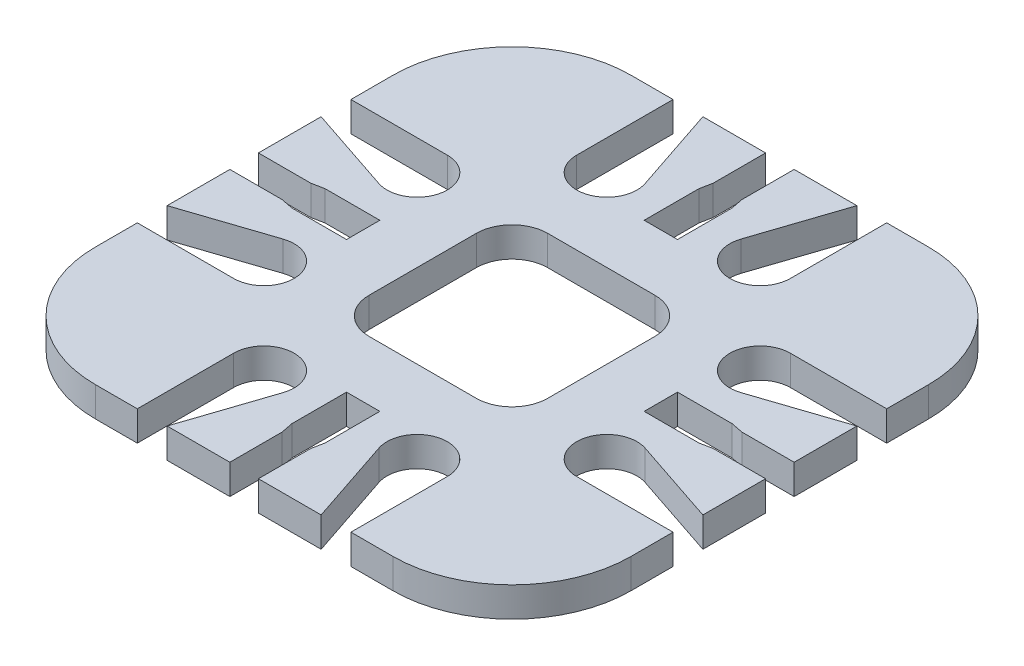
ISO-10303-21;
HEADER;
FILE_DESCRIPTION(('STEP AP214'),'2;1');
FILE_NAME('part.step','',(''),(''),'','','');
FILE_SCHEMA(('AUTOMOTIVE_DESIGN { 1 0 10303 214 1 1 1 1 }'));
ENDSEC;
DATA;
#1=APPLICATION_CONTEXT('core data for automotive mechanical design processes');
#2=APPLICATION_PROTOCOL_DEFINITION('international standard','automotive_design',2000,#1);
#3=PRODUCT_CONTEXT('',#1,'mechanical');
#4=PRODUCT('Part','Part','',(#3));
#5=PRODUCT_RELATED_PRODUCT_CATEGORY('part','',(#4));
#6=PRODUCT_DEFINITION_FORMATION('','',#4);
#7=PRODUCT_DEFINITION_CONTEXT('part definition',#1,'design');
#8=PRODUCT_DEFINITION('design','',#6,#7);
#9=PRODUCT_DEFINITION_SHAPE('','',#8);
#10=(LENGTH_UNIT() NAMED_UNIT(*) SI_UNIT(.MILLI.,.METRE.));
#11=(NAMED_UNIT(*) PLANE_ANGLE_UNIT() SI_UNIT($,.RADIAN.));
#12=(NAMED_UNIT(*) SI_UNIT($,.STERADIAN.) SOLID_ANGLE_UNIT());
#13=UNCERTAINTY_MEASURE_WITH_UNIT(LENGTH_MEASURE(1.E-05),#10,'distance_accuracy_value','');
#14=(GEOMETRIC_REPRESENTATION_CONTEXT(3) GLOBAL_UNCERTAINTY_ASSIGNED_CONTEXT((#13)) GLOBAL_UNIT_ASSIGNED_CONTEXT((#10,
#11,#12)) REPRESENTATION_CONTEXT('',''));
#15=CARTESIAN_POINT('',(0.,0.,0.));
#16=DIRECTION('',(0.,0.,1.));
#17=DIRECTION('',(1.,0.,0.));
#18=AXIS2_PLACEMENT_3D('',#15,#16,#17);
#19=CARTESIAN_POINT('',(6.43648740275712,2.5,14.4042276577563));
#20=DIRECTION('',(0.,-1.,0.));
#21=DIRECTION('',(0.,0.,-1.));
#22=AXIS2_PLACEMENT_3D('',#19,#20,#21);
#23=PLANE('',#22);
#24=DIRECTION('',(1.,0.,0.));
#25=VECTOR('',#24,1.);
#26=CARTESIAN_POINT('',(1.2,2.5,22.5));
#27=LINE('',#26,#25);
#28=CARTESIAN_POINT('',(1.2,2.5,22.5));
#29=VERTEX_POINT('',#28);
#30=CARTESIAN_POINT('',(6.4679674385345,2.5,22.5));
#31=VERTEX_POINT('',#30);
#32=EDGE_CURVE('E597',#29,#31,#27,.T.);
#33=ORIENTED_EDGE('',*,*,#32,.T.);
#34=DIRECTION('',(-0.316998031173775,0.,-0.948426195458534));
#35=VECTOR('',#34,1.);
#36=CARTESIAN_POINT('',(6.4679674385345,2.5,22.5));
#37=LINE('',#36,#35);
#38=CARTESIAN_POINT('',(4.03081630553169,2.5,15.2082891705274));
#39=VERTEX_POINT('',#38);
#40=EDGE_CURVE('E600',#31,#39,#37,.T.);
#41=ORIENTED_EDGE('',*,*,#40,.T.);
#42=CARTESIAN_POINT('',(6.43648740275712,2.5,14.4042276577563));
#43=DIRECTION('',(0.,-1.,0.));
#44=DIRECTION('',(0.,0.,-1.));
#45=AXIS2_PLACEMENT_3D('',#42,#43,#44);
#46=CIRCLE('',#45,2.53648740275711);
#47=CARTESIAN_POINT('',(8.97297480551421,2.5,14.4042276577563));
#48=VERTEX_POINT('',#47);
#49=EDGE_CURVE('E603',#39,#48,#46,.T.);
#50=ORIENTED_EDGE('',*,*,#49,.T.);
#51=DIRECTION('',(0.,0.,1.));
#52=VECTOR('',#51,1.);
#53=CARTESIAN_POINT('',(8.97297480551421,2.5,22.5));
#54=LINE('',#53,#52);
#55=CARTESIAN_POINT('',(8.97297480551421,2.5,22.5));
#56=VERTEX_POINT('',#55);
#57=EDGE_CURVE('E605',#48,#56,#54,.T.);
#58=ORIENTED_EDGE('',*,*,#57,.T.);
#59=DIRECTION('',(1.,0.,0.));
#60=VECTOR('',#59,1.);
#61=CARTESIAN_POINT('',(8.97297480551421,2.5,22.5));
#62=LINE('',#61,#60);
#63=CARTESIAN_POINT('',(12.4999999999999,2.5,22.5));
#64=VERTEX_POINT('',#63);
#65=EDGE_CURVE('E607',#56,#64,#62,.T.);
#66=ORIENTED_EDGE('',*,*,#65,.T.);
#67=CARTESIAN_POINT('',(12.5,2.5,12.5));
#68=DIRECTION('',(0.,1.,0.));
#69=DIRECTION('',(0.,0.,1.));
#70=AXIS2_PLACEMENT_3D('',#67,#68,#69);
#71=CIRCLE('',#70,10.);
#72=CARTESIAN_POINT('',(22.5,2.5,12.4999999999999));
#73=VERTEX_POINT('',#72);
#74=EDGE_CURVE('E609',#64,#73,#71,.T.);
#75=ORIENTED_EDGE('',*,*,#74,.T.);
#76=DIRECTION('',(0.,0.,-1.));
#77=VECTOR('',#76,1.);
#78=CARTESIAN_POINT('',(22.5,2.5,8.9729748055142));
#79=LINE('',#78,#77);
#80=CARTESIAN_POINT('',(22.5,2.5,8.9729748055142));
#81=VERTEX_POINT('',#80);
#82=EDGE_CURVE('E611',#73,#81,#79,.T.);
#83=ORIENTED_EDGE('',*,*,#82,.T.);
#84=DIRECTION('',(-1.,0.,0.));
#85=VECTOR('',#84,1.);
#86=CARTESIAN_POINT('',(22.5,2.5,8.9729748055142));
#87=LINE('',#86,#85);
#88=CARTESIAN_POINT('',(14.4042276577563,2.5,8.97297480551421));
#89=VERTEX_POINT('',#88);
#90=EDGE_CURVE('E613',#81,#89,#87,.T.);
#91=ORIENTED_EDGE('',*,*,#90,.T.);
#92=CARTESIAN_POINT('',(14.4042276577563,2.5,6.4364874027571));
#93=DIRECTION('',(0.,-1.,0.));
#94=DIRECTION('',(0.,0.,1.));
#95=AXIS2_PLACEMENT_3D('',#92,#93,#94);
#96=CIRCLE('',#95,2.53648740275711);
#97=CARTESIAN_POINT('',(15.2082891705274,2.5,4.03081630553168));
#98=VERTEX_POINT('',#97);
#99=EDGE_CURVE('E615',#89,#98,#96,.T.);
#100=ORIENTED_EDGE('',*,*,#99,.T.);
#101=DIRECTION('',(0.948426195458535,0.,0.316998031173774));
#102=VECTOR('',#101,1.);
#103=CARTESIAN_POINT('',(22.5,2.5,6.46796743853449));
#104=LINE('',#103,#102);
#105=CARTESIAN_POINT('',(22.5,2.5,6.46796743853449));
#106=VERTEX_POINT('',#105);
#107=EDGE_CURVE('E617',#98,#106,#104,.T.);
#108=ORIENTED_EDGE('',*,*,#107,.T.);
#109=DIRECTION('',(0.,0.,-1.));
#110=VECTOR('',#109,1.);
#111=CARTESIAN_POINT('',(22.5,2.5,1.2));
#112=LINE('',#111,#110);
#113=CARTESIAN_POINT('',(22.5,2.5,1.2));
#114=VERTEX_POINT('',#113);
#115=EDGE_CURVE('E619',#106,#114,#112,.T.);
#116=ORIENTED_EDGE('',*,*,#115,.T.);
#117=DIRECTION('',(-1.,0.,0.));
#118=VECTOR('',#117,1.);
#119=CARTESIAN_POINT('',(18.1,2.5,1.2));
#120=LINE('',#119,#118);
#121=CARTESIAN_POINT('',(18.1,2.5,1.2));
#122=VERTEX_POINT('',#121);
#123=EDGE_CURVE('E621',#114,#122,#120,.T.);
#124=ORIENTED_EDGE('',*,*,#123,.T.);
#125=DIRECTION('',(-0.98058067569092,0.,0.196116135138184));
#126=VECTOR('',#125,1.);
#127=CARTESIAN_POINT('',(17.1,2.5,1.4));
#128=LINE('',#127,#126);
#129=CARTESIAN_POINT('',(17.1,2.5,1.4));
#130=VERTEX_POINT('',#129);
#131=EDGE_CURVE('E623',#122,#130,#128,.T.);
#132=ORIENTED_EDGE('',*,*,#131,.T.);
#133=DIRECTION('',(-1.,0.,0.));
#134=VECTOR('',#133,1.);
#135=CARTESIAN_POINT('',(12.5,2.5,1.4));
#136=LINE('',#135,#134);
#137=CARTESIAN_POINT('',(12.5,2.5,1.4));
#138=VERTEX_POINT('',#137);
#139=EDGE_CURVE('E625',#130,#138,#136,.T.);
#140=ORIENTED_EDGE('',*,*,#139,.T.);
#141=DIRECTION('',(0.,0.,-1.));
#142=VECTOR('',#141,1.);
#143=CARTESIAN_POINT('',(12.5,2.5,-1.40000000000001));
#144=LINE('',#143,#142);
#145=CARTESIAN_POINT('',(12.5,2.5,-1.40000000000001));
#146=VERTEX_POINT('',#145);
#147=EDGE_CURVE('E627',#138,#146,#144,.T.);
#148=ORIENTED_EDGE('',*,*,#147,.T.);
#149=DIRECTION('',(1.,0.,0.));
#150=VECTOR('',#149,1.);
#151=CARTESIAN_POINT('',(17.1,2.5,-1.40000000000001));
#152=LINE('',#151,#150);
#153=CARTESIAN_POINT('',(17.1,2.5,-1.40000000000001));
#154=VERTEX_POINT('',#153);
#155=EDGE_CURVE('E629',#146,#154,#152,.T.);
#156=ORIENTED_EDGE('',*,*,#155,.T.);
#157=DIRECTION('',(0.98058067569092,0.,0.196116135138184));
#158=VECTOR('',#157,1.);
#159=CARTESIAN_POINT('',(17.1,2.5,-1.40000000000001));
#160=LINE('',#159,#158);
#161=CARTESIAN_POINT('',(18.1,2.5,-1.20000000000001));
#162=VERTEX_POINT('',#161);
#163=EDGE_CURVE('E631',#154,#162,#160,.T.);
#164=ORIENTED_EDGE('',*,*,#163,.T.);
#165=DIRECTION('',(1.,0.,0.));
#166=VECTOR('',#165,1.);
#167=CARTESIAN_POINT('',(22.5,2.5,-1.2));
#168=LINE('',#167,#166);
#169=CARTESIAN_POINT('',(22.5,2.5,-1.2));
#170=VERTEX_POINT('',#169);
#171=EDGE_CURVE('E633',#162,#170,#168,.T.);
#172=ORIENTED_EDGE('',*,*,#171,.T.);
#173=DIRECTION('',(0.,0.,-1.));
#174=VECTOR('',#173,1.);
#175=CARTESIAN_POINT('',(22.5,2.5,-6.46796743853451));
#176=LINE('',#175,#174);
#177=CARTESIAN_POINT('',(22.5,2.5,-6.46796743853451));
#178=VERTEX_POINT('',#177);
#179=EDGE_CURVE('E635',#170,#178,#176,.T.);
#180=ORIENTED_EDGE('',*,*,#179,.T.);
#181=DIRECTION('',(-0.948426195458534,0.,0.316998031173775));
#182=VECTOR('',#181,1.);
#183=CARTESIAN_POINT('',(22.5,2.5,-6.46796743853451));
#184=LINE('',#183,#182);
#185=CARTESIAN_POINT('',(15.2082891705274,2.5,-4.0308163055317));
#186=VERTEX_POINT('',#185);
#187=EDGE_CURVE('E637',#178,#186,#184,.T.);
#188=ORIENTED_EDGE('',*,*,#187,.T.);
#189=CARTESIAN_POINT('',(14.4042276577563,2.5,-6.43648740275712));
#190=DIRECTION('',(0.,-1.,0.));
#191=DIRECTION('',(0.,0.,-1.));
#192=AXIS2_PLACEMENT_3D('',#189,#190,#191);
#193=CIRCLE('',#192,2.53648740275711);
#194=CARTESIAN_POINT('',(14.4042276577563,2.5,-8.97297480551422));
#195=VERTEX_POINT('',#194);
#196=EDGE_CURVE('E639',#186,#195,#193,.T.);
#197=ORIENTED_EDGE('',*,*,#196,.T.);
#198=DIRECTION('',(1.,0.,0.));
#199=VECTOR('',#198,1.);
#200=CARTESIAN_POINT('',(22.5,2.5,-8.97297480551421));
#201=LINE('',#200,#199);
#202=CARTESIAN_POINT('',(22.5,2.5,-8.97297480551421));
#203=VERTEX_POINT('',#202);
#204=EDGE_CURVE('E641',#195,#203,#201,.T.);
#205=ORIENTED_EDGE('',*,*,#204,.T.);
#206=DIRECTION('',(0.,0.,-1.));
#207=VECTOR('',#206,1.);
#208=CARTESIAN_POINT('',(22.5,2.5,-12.4999999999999));
#209=LINE('',#208,#207);
#210=CARTESIAN_POINT('',(22.5,2.5,-12.4999999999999));
#211=VERTEX_POINT('',#210);
#212=EDGE_CURVE('E643',#203,#211,#209,.T.);
#213=ORIENTED_EDGE('',*,*,#212,.T.);
#214=CARTESIAN_POINT('',(12.5,2.5,-12.5));
#215=DIRECTION('',(0.,1.,0.));
#216=DIRECTION('',(0.,0.,-1.));
#217=AXIS2_PLACEMENT_3D('',#214,#215,#216);
#218=CIRCLE('',#217,10.);
#219=CARTESIAN_POINT('',(12.4999999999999,2.5,-22.5));
#220=VERTEX_POINT('',#219);
#221=EDGE_CURVE('E645',#211,#220,#218,.T.);
#222=ORIENTED_EDGE('',*,*,#221,.T.);
#223=DIRECTION('',(-1.,0.,0.));
#224=VECTOR('',#223,1.);
#225=CARTESIAN_POINT('',(8.97297480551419,2.5,-22.5));
#226=LINE('',#225,#224);
#227=CARTESIAN_POINT('',(8.97297480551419,2.5,-22.5));
#228=VERTEX_POINT('',#227);
#229=EDGE_CURVE('E647',#220,#228,#226,.T.);
#230=ORIENTED_EDGE('',*,*,#229,.T.);
#231=DIRECTION('',(0.,0.,1.));
#232=VECTOR('',#231,1.);
#233=CARTESIAN_POINT('',(8.97297480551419,2.5,-22.5));
#234=LINE('',#233,#232);
#235=CARTESIAN_POINT('',(8.97297480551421,2.5,-14.4042276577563));
#236=VERTEX_POINT('',#235);
#237=EDGE_CURVE('E649',#228,#236,#234,.T.);
#238=ORIENTED_EDGE('',*,*,#237,.T.);
#239=CARTESIAN_POINT('',(6.4364874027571,2.5,-14.4042276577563));
#240=DIRECTION('',(0.,-1.,0.));
#241=DIRECTION('',(0.,0.,1.));
#242=AXIS2_PLACEMENT_3D('',#239,#240,#241);
#243=CIRCLE('',#242,2.53648740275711);
#244=CARTESIAN_POINT('',(4.03081630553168,2.5,-15.2082891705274));
#245=VERTEX_POINT('',#244);
#246=EDGE_CURVE('E651',#236,#245,#243,.T.);
#247=ORIENTED_EDGE('',*,*,#246,.T.);
#248=DIRECTION('',(0.316998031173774,0.,-0.948426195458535));
#249=VECTOR('',#248,1.);
#250=CARTESIAN_POINT('',(6.46796743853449,2.5,-22.5));
#251=LINE('',#250,#249);
#252=CARTESIAN_POINT('',(6.46796743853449,2.5,-22.5));
#253=VERTEX_POINT('',#252);
#254=EDGE_CURVE('E653',#245,#253,#251,.T.);
#255=ORIENTED_EDGE('',*,*,#254,.T.);
#256=DIRECTION('',(-1.,0.,0.));
#257=VECTOR('',#256,1.);
#258=CARTESIAN_POINT('',(1.2,2.5,-22.5));
#259=LINE('',#258,#257);
#260=CARTESIAN_POINT('',(1.2,2.5,-22.5));
#261=VERTEX_POINT('',#260);
#262=EDGE_CURVE('E655',#253,#261,#259,.T.);
#263=ORIENTED_EDGE('',*,*,#262,.T.);
#264=DIRECTION('',(0.,0.,1.));
#265=VECTOR('',#264,1.);
#266=CARTESIAN_POINT('',(1.2,2.5,-18.1));
#267=LINE('',#266,#265);
#268=CARTESIAN_POINT('',(1.2,2.5,-18.1));
#269=VERTEX_POINT('',#268);
#270=EDGE_CURVE('E657',#261,#269,#267,.T.);
#271=ORIENTED_EDGE('',*,*,#270,.T.);
#272=DIRECTION('',(0.196116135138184,0.,0.98058067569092));
#273=VECTOR('',#272,1.);
#274=CARTESIAN_POINT('',(1.4,2.5,-17.1));
#275=LINE('',#274,#273);
#276=CARTESIAN_POINT('',(1.4,2.5,-17.1));
#277=VERTEX_POINT('',#276);
#278=EDGE_CURVE('E659',#269,#277,#275,.T.);
#279=ORIENTED_EDGE('',*,*,#278,.T.);
#280=DIRECTION('',(0.,0.,1.));
#281=VECTOR('',#280,1.);
#282=CARTESIAN_POINT('',(1.4,2.5,-12.5));
#283=LINE('',#282,#281);
#284=CARTESIAN_POINT('',(1.4,2.5,-12.5));
#285=VERTEX_POINT('',#284);
#286=EDGE_CURVE('E661',#277,#285,#283,.T.);
#287=ORIENTED_EDGE('',*,*,#286,.T.);
#288=DIRECTION('',(-1.,0.,0.));
#289=VECTOR('',#288,1.);
#290=CARTESIAN_POINT('',(-1.40000000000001,2.5,-12.5));
#291=LINE('',#290,#289);
#292=CARTESIAN_POINT('',(-1.40000000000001,2.5,-12.5));
#293=VERTEX_POINT('',#292);
#294=EDGE_CURVE('E663',#285,#293,#291,.T.);
#295=ORIENTED_EDGE('',*,*,#294,.T.);
#296=DIRECTION('',(0.,0.,-1.));
#297=VECTOR('',#296,1.);
#298=CARTESIAN_POINT('',(-1.40000000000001,2.5,-17.1));
#299=LINE('',#298,#297);
#300=CARTESIAN_POINT('',(-1.40000000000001,2.5,-17.1));
#301=VERTEX_POINT('',#300);
#302=EDGE_CURVE('E665',#293,#301,#299,.T.);
#303=ORIENTED_EDGE('',*,*,#302,.T.);
#304=DIRECTION('',(0.196116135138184,0.,-0.98058067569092));
#305=VECTOR('',#304,1.);
#306=CARTESIAN_POINT('',(-1.40000000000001,2.5,-17.1));
#307=LINE('',#306,#305);
#308=CARTESIAN_POINT('',(-1.20000000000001,2.5,-18.1));
#309=VERTEX_POINT('',#308);
#310=EDGE_CURVE('E667',#301,#309,#307,.T.);
#311=ORIENTED_EDGE('',*,*,#310,.T.);
#312=DIRECTION('',(0.,0.,-1.));
#313=VECTOR('',#312,1.);
#314=CARTESIAN_POINT('',(-1.2,2.5,-22.5));
#315=LINE('',#314,#313);
#316=CARTESIAN_POINT('',(-1.2,2.5,-22.5));
#317=VERTEX_POINT('',#316);
#318=EDGE_CURVE('E669',#309,#317,#315,.T.);
#319=ORIENTED_EDGE('',*,*,#318,.T.);
#320=DIRECTION('',(-1.,0.,0.));
#321=VECTOR('',#320,1.);
#322=CARTESIAN_POINT('',(-6.46796743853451,2.5,-22.5));
#323=LINE('',#322,#321);
#324=CARTESIAN_POINT('',(-6.46796743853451,2.5,-22.5));
#325=VERTEX_POINT('',#324);
#326=EDGE_CURVE('E671',#317,#325,#323,.T.);
#327=ORIENTED_EDGE('',*,*,#326,.T.);
#328=DIRECTION('',(0.316998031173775,0.,0.948426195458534));
#329=VECTOR('',#328,1.);
#330=CARTESIAN_POINT('',(-6.46796743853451,2.5,-22.5));
#331=LINE('',#330,#329);
#332=CARTESIAN_POINT('',(-4.0308163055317,2.5,-15.2082891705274));
#333=VERTEX_POINT('',#332);
#334=EDGE_CURVE('E673',#325,#333,#331,.T.);
#335=ORIENTED_EDGE('',*,*,#334,.T.);
#336=CARTESIAN_POINT('',(-6.43648740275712,2.5,-14.4042276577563));
#337=DIRECTION('',(0.,-1.,0.));
#338=DIRECTION('',(0.,0.,-1.));
#339=AXIS2_PLACEMENT_3D('',#336,#337,#338);
#340=CIRCLE('',#339,2.53648740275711);
#341=CARTESIAN_POINT('',(-8.97297480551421,2.5,-14.4042276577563));
#342=VERTEX_POINT('',#341);
#343=EDGE_CURVE('E675',#333,#342,#340,.T.);
#344=ORIENTED_EDGE('',*,*,#343,.T.);
#345=DIRECTION('',(0.,0.,-1.));
#346=VECTOR('',#345,1.);
#347=CARTESIAN_POINT('',(-8.97297480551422,2.5,-22.5));
#348=LINE('',#347,#346);
#349=CARTESIAN_POINT('',(-8.97297480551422,2.5,-22.5));
#350=VERTEX_POINT('',#349);
#351=EDGE_CURVE('E677',#342,#350,#348,.T.);
#352=ORIENTED_EDGE('',*,*,#351,.T.);
#353=DIRECTION('',(-1.,0.,0.));
#354=VECTOR('',#353,1.);
#355=CARTESIAN_POINT('',(-12.4999999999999,2.5,-22.5));
#356=LINE('',#355,#354);
#357=CARTESIAN_POINT('',(-12.4999999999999,2.5,-22.5));
#358=VERTEX_POINT('',#357);
#359=EDGE_CURVE('E679',#350,#358,#356,.T.);
#360=ORIENTED_EDGE('',*,*,#359,.T.);
#361=CARTESIAN_POINT('',(-12.5,2.5,-12.5));
#362=DIRECTION('',(0.,1.,0.));
#363=DIRECTION('',(0.,0.,1.));
#364=AXIS2_PLACEMENT_3D('',#361,#362,#363);
#365=CIRCLE('',#364,10.);
#366=CARTESIAN_POINT('',(-22.5,2.5,-12.4999999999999));
#367=VERTEX_POINT('',#366);
#368=EDGE_CURVE('E681',#358,#367,#365,.T.);
#369=ORIENTED_EDGE('',*,*,#368,.T.);
#370=DIRECTION('',(0.,0.,1.));
#371=VECTOR('',#370,1.);
#372=CARTESIAN_POINT('',(-22.5,2.5,-12.4999999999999));
#373=LINE('',#372,#371);
#374=CARTESIAN_POINT('',(-22.5,2.5,-8.9729748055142));
#375=VERTEX_POINT('',#374);
#376=EDGE_CURVE('E683',#367,#375,#373,.T.);
#377=ORIENTED_EDGE('',*,*,#376,.T.);
#378=DIRECTION('',(1.,0.,0.));
#379=VECTOR('',#378,1.);
#380=CARTESIAN_POINT('',(-22.5,2.5,-8.9729748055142));
#381=LINE('',#380,#379);
#382=CARTESIAN_POINT('',(-14.4042276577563,2.5,-8.97297480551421));
#383=VERTEX_POINT('',#382);
#384=EDGE_CURVE('E685',#375,#383,#381,.T.);
#385=ORIENTED_EDGE('',*,*,#384,.T.);
#386=CARTESIAN_POINT('',(-14.4042276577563,2.5,-6.4364874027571));
#387=DIRECTION('',(0.,-1.,0.));
#388=DIRECTION('',(0.,0.,1.));
#389=AXIS2_PLACEMENT_3D('',#386,#387,#388);
#390=CIRCLE('',#389,2.53648740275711);
#391=CARTESIAN_POINT('',(-15.2082891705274,2.5,-4.03081630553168));
#392=VERTEX_POINT('',#391);
#393=EDGE_CURVE('E687',#383,#392,#390,.T.);
#394=ORIENTED_EDGE('',*,*,#393,.T.);
#395=DIRECTION('',(-0.948426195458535,0.,-0.316998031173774));
#396=VECTOR('',#395,1.);
#397=CARTESIAN_POINT('',(-22.5,2.5,-6.46796743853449));
#398=LINE('',#397,#396);
#399=CARTESIAN_POINT('',(-22.5,2.5,-6.46796743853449));
#400=VERTEX_POINT('',#399);
#401=EDGE_CURVE('E689',#392,#400,#398,.T.);
#402=ORIENTED_EDGE('',*,*,#401,.T.);
#403=DIRECTION('',(0.,0.,1.));
#404=VECTOR('',#403,1.);
#405=CARTESIAN_POINT('',(-22.5,2.5,-6.46796743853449));
#406=LINE('',#405,#404);
#407=CARTESIAN_POINT('',(-22.5,2.5,-1.2));
#408=VERTEX_POINT('',#407);
#409=EDGE_CURVE('E691',#400,#408,#406,.T.);
#410=ORIENTED_EDGE('',*,*,#409,.T.);
#411=DIRECTION('',(1.,0.,0.));
#412=VECTOR('',#411,1.);
#413=CARTESIAN_POINT('',(-18.1,2.5,-1.2));
#414=LINE('',#413,#412);
#415=CARTESIAN_POINT('',(-18.1,2.5,-1.2));
#416=VERTEX_POINT('',#415);
#417=EDGE_CURVE('E693',#408,#416,#414,.T.);
#418=ORIENTED_EDGE('',*,*,#417,.T.);
#419=DIRECTION('',(0.98058067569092,0.,-0.196116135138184));
#420=VECTOR('',#419,1.);
#421=CARTESIAN_POINT('',(-17.1,2.5,-1.4));
#422=LINE('',#421,#420);
#423=CARTESIAN_POINT('',(-17.1,2.5,-1.4));
#424=VERTEX_POINT('',#423);
#425=EDGE_CURVE('E695',#416,#424,#422,.T.);
#426=ORIENTED_EDGE('',*,*,#425,.T.);
#427=DIRECTION('',(1.,0.,0.));
#428=VECTOR('',#427,1.);
#429=CARTESIAN_POINT('',(-12.5,2.5,-1.4));
#430=LINE('',#429,#428);
#431=CARTESIAN_POINT('',(-12.5,2.5,-1.4));
#432=VERTEX_POINT('',#431);
#433=EDGE_CURVE('E697',#424,#432,#430,.T.);
#434=ORIENTED_EDGE('',*,*,#433,.T.);
#435=DIRECTION('',(0.,0.,1.));
#436=VECTOR('',#435,1.);
#437=CARTESIAN_POINT('',(-12.5,2.5,1.40000000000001));
#438=LINE('',#437,#436);
#439=CARTESIAN_POINT('',(-12.5,2.5,1.40000000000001));
#440=VERTEX_POINT('',#439);
#441=EDGE_CURVE('E699',#432,#440,#438,.T.);
#442=ORIENTED_EDGE('',*,*,#441,.T.);
#443=DIRECTION('',(-1.,0.,0.));
#444=VECTOR('',#443,1.);
#445=CARTESIAN_POINT('',(-17.1,2.5,1.40000000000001));
#446=LINE('',#445,#444);
#447=CARTESIAN_POINT('',(-17.1,2.5,1.40000000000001));
#448=VERTEX_POINT('',#447);
#449=EDGE_CURVE('E701',#440,#448,#446,.T.);
#450=ORIENTED_EDGE('',*,*,#449,.T.);
#451=DIRECTION('',(-0.98058067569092,0.,-0.196116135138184));
#452=VECTOR('',#451,1.);
#453=CARTESIAN_POINT('',(-17.1,2.5,1.40000000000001));
#454=LINE('',#453,#452);
#455=CARTESIAN_POINT('',(-18.1,2.5,1.20000000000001));
#456=VERTEX_POINT('',#455);
#457=EDGE_CURVE('E703',#448,#456,#454,.T.);
#458=ORIENTED_EDGE('',*,*,#457,.T.);
#459=DIRECTION('',(-1.,0.,0.));
#460=VECTOR('',#459,1.);
#461=CARTESIAN_POINT('',(-22.5,2.5,1.2));
#462=LINE('',#461,#460);
#463=CARTESIAN_POINT('',(-22.5,2.5,1.2));
#464=VERTEX_POINT('',#463);
#465=EDGE_CURVE('E705',#456,#464,#462,.T.);
#466=ORIENTED_EDGE('',*,*,#465,.T.);
#467=DIRECTION('',(0.,0.,1.));
#468=VECTOR('',#467,1.);
#469=CARTESIAN_POINT('',(-22.5,2.5,1.2));
#470=LINE('',#469,#468);
#471=CARTESIAN_POINT('',(-22.5,2.5,6.46796743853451));
#472=VERTEX_POINT('',#471);
#473=EDGE_CURVE('E707',#464,#472,#470,.T.);
#474=ORIENTED_EDGE('',*,*,#473,.T.);
#475=DIRECTION('',(0.948426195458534,0.,-0.316998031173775));
#476=VECTOR('',#475,1.);
#477=CARTESIAN_POINT('',(-22.5,2.5,6.46796743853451));
#478=LINE('',#477,#476);
#479=CARTESIAN_POINT('',(-15.2082891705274,2.5,4.0308163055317));
#480=VERTEX_POINT('',#479);
#481=EDGE_CURVE('E709',#472,#480,#478,.T.);
#482=ORIENTED_EDGE('',*,*,#481,.T.);
#483=CARTESIAN_POINT('',(-14.4042276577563,2.5,6.43648740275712));
#484=DIRECTION('',(0.,-1.,0.));
#485=DIRECTION('',(0.,0.,-1.));
#486=AXIS2_PLACEMENT_3D('',#483,#484,#485);
#487=CIRCLE('',#486,2.53648740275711);
#488=CARTESIAN_POINT('',(-14.4042276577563,2.5,8.97297480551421));
#489=VERTEX_POINT('',#488);
#490=EDGE_CURVE('E711',#480,#489,#487,.T.);
#491=ORIENTED_EDGE('',*,*,#490,.T.);
#492=DIRECTION('',(-1.,0.,0.));
#493=VECTOR('',#492,1.);
#494=CARTESIAN_POINT('',(-22.5,2.5,8.97297480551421));
#495=LINE('',#494,#493);
#496=CARTESIAN_POINT('',(-22.5,2.5,8.97297480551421));
#497=VERTEX_POINT('',#496);
#498=EDGE_CURVE('E713',#489,#497,#495,.T.);
#499=ORIENTED_EDGE('',*,*,#498,.T.);
#500=DIRECTION('',(0.,0.,1.));
#501=VECTOR('',#500,1.);
#502=CARTESIAN_POINT('',(-22.5,2.5,8.97297480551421));
#503=LINE('',#502,#501);
#504=CARTESIAN_POINT('',(-22.5,2.5,12.4999999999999));
#505=VERTEX_POINT('',#504);
#506=EDGE_CURVE('E715',#497,#505,#503,.T.);
#507=ORIENTED_EDGE('',*,*,#506,.T.);
#508=CARTESIAN_POINT('',(-12.5,2.5,12.5));
#509=DIRECTION('',(0.,1.,0.));
#510=DIRECTION('',(0.,0.,1.));
#511=AXIS2_PLACEMENT_3D('',#508,#509,#510);
#512=CIRCLE('',#511,10.);
#513=CARTESIAN_POINT('',(-12.4999999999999,2.5,22.5));
#514=VERTEX_POINT('',#513);
#515=EDGE_CURVE('E717',#505,#514,#512,.T.);
#516=ORIENTED_EDGE('',*,*,#515,.T.);
#517=DIRECTION('',(1.,0.,0.));
#518=VECTOR('',#517,1.);
#519=CARTESIAN_POINT('',(-12.4999999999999,2.5,22.5));
#520=LINE('',#519,#518);
#521=CARTESIAN_POINT('',(-8.9729748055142,2.5,22.5));
#522=VERTEX_POINT('',#521);
#523=EDGE_CURVE('E719',#514,#522,#520,.T.);
#524=ORIENTED_EDGE('',*,*,#523,.T.);
#525=DIRECTION('',(0.,0.,-1.));
#526=VECTOR('',#525,1.);
#527=CARTESIAN_POINT('',(-8.9729748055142,2.5,22.5));
#528=LINE('',#527,#526);
#529=CARTESIAN_POINT('',(-8.97297480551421,2.5,14.4042276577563));
#530=VERTEX_POINT('',#529);
#531=EDGE_CURVE('E721',#522,#530,#528,.T.);
#532=ORIENTED_EDGE('',*,*,#531,.T.);
#533=CARTESIAN_POINT('',(-6.43648740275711,2.5,14.4042276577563));
#534=DIRECTION('',(0.,-1.,0.));
#535=DIRECTION('',(0.,0.,1.));
#536=AXIS2_PLACEMENT_3D('',#533,#534,#535);
#537=CIRCLE('',#536,2.53648740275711);
#538=CARTESIAN_POINT('',(-4.03081630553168,2.5,15.2082891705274));
#539=VERTEX_POINT('',#538);
#540=EDGE_CURVE('E723',#530,#539,#537,.T.);
#541=ORIENTED_EDGE('',*,*,#540,.T.);
#542=DIRECTION('',(-0.316998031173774,0.,0.948426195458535));
#543=VECTOR('',#542,1.);
#544=CARTESIAN_POINT('',(-6.46796743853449,2.5,22.5));
#545=LINE('',#544,#543);
#546=CARTESIAN_POINT('',(-6.46796743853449,2.5,22.5));
#547=VERTEX_POINT('',#546);
#548=EDGE_CURVE('E725',#539,#547,#545,.T.);
#549=ORIENTED_EDGE('',*,*,#548,.T.);
#550=DIRECTION('',(1.,0.,0.));
#551=VECTOR('',#550,1.);
#552=CARTESIAN_POINT('',(-6.46796743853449,2.5,22.5));
#553=LINE('',#552,#551);
#554=CARTESIAN_POINT('',(-1.2,2.5,22.5));
#555=VERTEX_POINT('',#554);
#556=EDGE_CURVE('E727',#547,#555,#553,.T.);
#557=ORIENTED_EDGE('',*,*,#556,.T.);
#558=DIRECTION('',(0.,0.,-1.));
#559=VECTOR('',#558,1.);
#560=CARTESIAN_POINT('',(-1.2,2.5,18.1));
#561=LINE('',#560,#559);
#562=CARTESIAN_POINT('',(-1.2,2.5,18.1));
#563=VERTEX_POINT('',#562);
#564=EDGE_CURVE('E729',#555,#563,#561,.T.);
#565=ORIENTED_EDGE('',*,*,#564,.T.);
#566=DIRECTION('',(-0.196116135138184,0.,-0.98058067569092));
#567=VECTOR('',#566,1.);
#568=CARTESIAN_POINT('',(-1.4,2.5,17.1));
#569=LINE('',#568,#567);
#570=CARTESIAN_POINT('',(-1.4,2.5,17.1));
#571=VERTEX_POINT('',#570);
#572=EDGE_CURVE('E731',#563,#571,#569,.T.);
#573=ORIENTED_EDGE('',*,*,#572,.T.);
#574=DIRECTION('',(0.,0.,-1.));
#575=VECTOR('',#574,1.);
#576=CARTESIAN_POINT('',(-1.4,2.5,12.5));
#577=LINE('',#576,#575);
#578=CARTESIAN_POINT('',(-1.4,2.5,12.5));
#579=VERTEX_POINT('',#578);
#580=EDGE_CURVE('E733',#571,#579,#577,.T.);
#581=ORIENTED_EDGE('',*,*,#580,.T.);
#582=DIRECTION('',(1.,0.,0.));
#583=VECTOR('',#582,1.);
#584=CARTESIAN_POINT('',(1.40000000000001,2.5,12.5));
#585=LINE('',#584,#583);
#586=CARTESIAN_POINT('',(1.40000000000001,2.5,12.5));
#587=VERTEX_POINT('',#586);
#588=EDGE_CURVE('E735',#579,#587,#585,.T.);
#589=ORIENTED_EDGE('',*,*,#588,.T.);
#590=DIRECTION('',(0.,0.,1.));
#591=VECTOR('',#590,1.);
#592=CARTESIAN_POINT('',(1.40000000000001,2.5,17.1));
#593=LINE('',#592,#591);
#594=CARTESIAN_POINT('',(1.40000000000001,2.5,17.1));
#595=VERTEX_POINT('',#594);
#596=EDGE_CURVE('E737',#587,#595,#593,.T.);
#597=ORIENTED_EDGE('',*,*,#596,.T.);
#598=DIRECTION('',(-0.196116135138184,0.,0.98058067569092));
#599=VECTOR('',#598,1.);
#600=CARTESIAN_POINT('',(1.40000000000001,2.5,17.1));
#601=LINE('',#600,#599);
#602=CARTESIAN_POINT('',(1.20000000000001,2.5,18.1));
#603=VERTEX_POINT('',#602);
#604=EDGE_CURVE('E739',#595,#603,#601,.T.);
#605=ORIENTED_EDGE('',*,*,#604,.T.);
#606=DIRECTION('',(0.,0.,1.));
#607=VECTOR('',#606,1.);
#608=CARTESIAN_POINT('',(1.2,2.5,22.5));
#609=LINE('',#608,#607);
#610=EDGE_CURVE('E741',#603,#29,#609,.T.);
#611=ORIENTED_EDGE('',*,*,#610,.T.);
#612=EDGE_LOOP('',(#33,#41,#50,#58,#66,#75,#83,#91,#100,#108,#116,#124,#132,#140,#148,#156,#164,
#172,#180,#188,#197,#205,#213,#222,#230,#238,#247,#255,#263,#271,#279,#287,#295,#303,#311,#319,
#327,#335,#344,#352,#360,#369,#377,#385,#394,#402,#410,#418,#426,#434,#442,#450,#458,#466,#474,
#482,#491,#499,#507,#516,#524,#532,#541,#549,#557,#565,#573,#581,#589,#597,#605,#611));
#613=FACE_BOUND('',#612,.T.);
#614=CARTESIAN_POINT('',(-4.5,2.5,-4.5));
#615=DIRECTION('',(0.,1.,0.));
#616=DIRECTION('',(0.,0.,1.));
#617=AXIS2_PLACEMENT_3D('',#614,#615,#616);
#618=CIRCLE('',#617,3.);
#619=CARTESIAN_POINT('',(-4.49999999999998,2.5,-7.5));
#620=VERTEX_POINT('',#619);
#621=CARTESIAN_POINT('',(-7.5,2.5,-4.49999999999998));
#622=VERTEX_POINT('',#621);
#623=EDGE_CURVE('E532',#620,#622,#618,.T.);
#624=ORIENTED_EDGE('',*,*,#623,.F.);
#625=DIRECTION('',(-1.,0.,0.));
#626=VECTOR('',#625,1.);
#627=CARTESIAN_POINT('',(-4.49999999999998,2.5,-7.5));
#628=LINE('',#627,#626);
#629=CARTESIAN_POINT('',(4.49999999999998,2.5,-7.5));
#630=VERTEX_POINT('',#629);
#631=EDGE_CURVE('E565',#630,#620,#628,.T.);
#632=ORIENTED_EDGE('',*,*,#631,.F.);
#633=CARTESIAN_POINT('',(4.5,2.5,-4.5));
#634=DIRECTION('',(0.,1.,0.));
#635=DIRECTION('',(0.,0.,-1.));
#636=AXIS2_PLACEMENT_3D('',#633,#634,#635);
#637=CIRCLE('',#636,3.);
#638=CARTESIAN_POINT('',(7.5,2.5,-4.49999999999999));
#639=VERTEX_POINT('',#638);
#640=EDGE_CURVE('E563',#639,#630,#637,.T.);
#641=ORIENTED_EDGE('',*,*,#640,.F.);
#642=DIRECTION('',(0.,0.,-1.));
#643=VECTOR('',#642,1.);
#644=CARTESIAN_POINT('',(7.5,2.5,-4.49999999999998));
#645=LINE('',#644,#643);
#646=CARTESIAN_POINT('',(7.50000000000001,2.5,4.49999999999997));
#647=VERTEX_POINT('',#646);
#648=EDGE_CURVE('E561',#647,#639,#645,.T.);
#649=ORIENTED_EDGE('',*,*,#648,.F.);
#650=CARTESIAN_POINT('',(4.50000000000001,2.5,4.5));
#651=DIRECTION('',(0.,1.,0.));
#652=DIRECTION('',(0.,0.,1.));
#653=AXIS2_PLACEMENT_3D('',#650,#651,#652);
#654=CIRCLE('',#653,3.);
#655=CARTESIAN_POINT('',(4.49999999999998,2.5,7.5));
#656=VERTEX_POINT('',#655);
#657=EDGE_CURVE('E559',#656,#647,#654,.T.);
#658=ORIENTED_EDGE('',*,*,#657,.F.);
#659=DIRECTION('',(1.,0.,0.));
#660=VECTOR('',#659,1.);
#661=CARTESIAN_POINT('',(-4.49999999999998,2.5,7.5));
#662=LINE('',#661,#660);
#663=CARTESIAN_POINT('',(-4.49999999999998,2.5,7.5));
#664=VERTEX_POINT('',#663);
#665=EDGE_CURVE('E555',#664,#656,#662,.T.);
#666=ORIENTED_EDGE('',*,*,#665,.F.);
#667=CARTESIAN_POINT('',(-4.5,2.5,4.5));
#668=DIRECTION('',(0.,1.,0.));
#669=DIRECTION('',(0.,0.,1.));
#670=AXIS2_PLACEMENT_3D('',#667,#668,#669);
#671=CIRCLE('',#670,3.);
#672=CARTESIAN_POINT('',(-7.5,2.5,4.49999999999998));
#673=VERTEX_POINT('',#672);
#674=EDGE_CURVE('E553',#673,#664,#671,.T.);
#675=ORIENTED_EDGE('',*,*,#674,.F.);
#676=DIRECTION('',(0.,0.,1.));
#677=VECTOR('',#676,1.);
#678=CARTESIAN_POINT('',(-7.5,2.5,-4.49999999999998));
#679=LINE('',#678,#677);
#680=EDGE_CURVE('E540',#622,#673,#679,.T.);
#681=ORIENTED_EDGE('',*,*,#680,.F.);
#682=EDGE_LOOP('',(#624,#632,#641,#649,#658,#666,#675,#681));
#683=FACE_BOUND('',#682,.T.);
#684=ADVANCED_FACE('F35',(#613,#683),#23,.F.);
#685=CARTESIAN_POINT('',(6.43648740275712,0.,14.4042276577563));
#686=DIRECTION('',(0.,-1.,0.));
#687=DIRECTION('',(0.,0.,-1.));
#688=AXIS2_PLACEMENT_3D('',#685,#686,#687);
#689=PLANE('',#688);
#690=DIRECTION('',(1.,0.,0.));
#691=VECTOR('',#690,1.);
#692=CARTESIAN_POINT('',(1.2,0.,22.5));
#693=LINE('',#692,#691);
#694=CARTESIAN_POINT('',(1.2,0.,22.5));
#695=VERTEX_POINT('',#694);
#696=CARTESIAN_POINT('',(6.4679674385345,0.,22.5));
#697=VERTEX_POINT('',#696);
#698=EDGE_CURVE('E548',#695,#697,#693,.T.);
#699=ORIENTED_EDGE('',*,*,#698,.F.);
#700=DIRECTION('',(0.,0.,1.));
#701=VECTOR('',#700,1.);
#702=CARTESIAN_POINT('',(1.2,0.,22.5));
#703=LINE('',#702,#701);
#704=CARTESIAN_POINT('',(1.20000000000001,0.,18.1));
#705=VERTEX_POINT('',#704);
#706=EDGE_CURVE('E601',#705,#695,#703,.T.);
#707=ORIENTED_EDGE('',*,*,#706,.F.);
#708=DIRECTION('',(-0.196116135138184,0.,0.98058067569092));
#709=VECTOR('',#708,1.);
#710=CARTESIAN_POINT('',(1.40000000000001,0.,17.1));
#711=LINE('',#710,#709);
#712=CARTESIAN_POINT('',(1.40000000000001,0.,17.1));
#713=VERTEX_POINT('',#712);
#714=EDGE_CURVE('E884',#713,#705,#711,.T.);
#715=ORIENTED_EDGE('',*,*,#714,.F.);
#716=DIRECTION('',(0.,0.,1.));
#717=VECTOR('',#716,1.);
#718=CARTESIAN_POINT('',(1.40000000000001,0.,17.1));
#719=LINE('',#718,#717);
#720=CARTESIAN_POINT('',(1.40000000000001,0.,12.5));
#721=VERTEX_POINT('',#720);
#722=EDGE_CURVE('E882',#721,#713,#719,.T.);
#723=ORIENTED_EDGE('',*,*,#722,.F.);
#724=DIRECTION('',(1.,0.,0.));
#725=VECTOR('',#724,1.);
#726=CARTESIAN_POINT('',(1.40000000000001,0.,12.5));
#727=LINE('',#726,#725);
#728=CARTESIAN_POINT('',(-1.4,0.,12.5));
#729=VERTEX_POINT('',#728);
#730=EDGE_CURVE('E880',#729,#721,#727,.T.);
#731=ORIENTED_EDGE('',*,*,#730,.F.);
#732=DIRECTION('',(0.,0.,-1.));
#733=VECTOR('',#732,1.);
#734=CARTESIAN_POINT('',(-1.4,0.,12.5));
#735=LINE('',#734,#733);
#736=CARTESIAN_POINT('',(-1.4,0.,17.1));
#737=VERTEX_POINT('',#736);
#738=EDGE_CURVE('E878',#737,#729,#735,.T.);
#739=ORIENTED_EDGE('',*,*,#738,.F.);
#740=DIRECTION('',(-0.196116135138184,0.,-0.98058067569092));
#741=VECTOR('',#740,1.);
#742=CARTESIAN_POINT('',(-1.4,0.,17.1));
#743=LINE('',#742,#741);
#744=CARTESIAN_POINT('',(-1.2,0.,18.1));
#745=VERTEX_POINT('',#744);
#746=EDGE_CURVE('E876',#745,#737,#743,.T.);
#747=ORIENTED_EDGE('',*,*,#746,.F.);
#748=DIRECTION('',(0.,0.,-1.));
#749=VECTOR('',#748,1.);
#750=CARTESIAN_POINT('',(-1.2,0.,18.1));
#751=LINE('',#750,#749);
#752=CARTESIAN_POINT('',(-1.2,0.,22.5));
#753=VERTEX_POINT('',#752);
#754=EDGE_CURVE('E874',#753,#745,#751,.T.);
#755=ORIENTED_EDGE('',*,*,#754,.F.);
#756=DIRECTION('',(1.,0.,0.));
#757=VECTOR('',#756,1.);
#758=CARTESIAN_POINT('',(-6.46796743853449,0.,22.5));
#759=LINE('',#758,#757);
#760=CARTESIAN_POINT('',(-6.46796743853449,0.,22.5));
#761=VERTEX_POINT('',#760);
#762=EDGE_CURVE('E872',#761,#753,#759,.T.);
#763=ORIENTED_EDGE('',*,*,#762,.F.);
#764=DIRECTION('',(-0.316998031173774,0.,0.948426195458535));
#765=VECTOR('',#764,1.);
#766=CARTESIAN_POINT('',(-6.46796743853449,0.,22.5));
#767=LINE('',#766,#765);
#768=CARTESIAN_POINT('',(-4.03081630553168,0.,15.2082891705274));
#769=VERTEX_POINT('',#768);
#770=EDGE_CURVE('E870',#769,#761,#767,.T.);
#771=ORIENTED_EDGE('',*,*,#770,.F.);
#772=CARTESIAN_POINT('',(-6.43648740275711,0.,14.4042276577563));
#773=DIRECTION('',(0.,-1.,0.));
#774=DIRECTION('',(0.,0.,1.));
#775=AXIS2_PLACEMENT_3D('',#772,#773,#774);
#776=CIRCLE('',#775,2.53648740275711);
#777=CARTESIAN_POINT('',(-8.97297480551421,0.,14.4042276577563));
#778=VERTEX_POINT('',#777);
#779=EDGE_CURVE('E868',#778,#769,#776,.T.);
#780=ORIENTED_EDGE('',*,*,#779,.F.);
#781=DIRECTION('',(0.,0.,-1.));
#782=VECTOR('',#781,1.);
#783=CARTESIAN_POINT('',(-8.9729748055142,0.,22.5));
#784=LINE('',#783,#782);
#785=CARTESIAN_POINT('',(-8.9729748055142,0.,22.5));
#786=VERTEX_POINT('',#785);
#787=EDGE_CURVE('E866',#786,#778,#784,.T.);
#788=ORIENTED_EDGE('',*,*,#787,.F.);
#789=DIRECTION('',(1.,0.,0.));
#790=VECTOR('',#789,1.);
#791=CARTESIAN_POINT('',(-12.4999999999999,0.,22.5));
#792=LINE('',#791,#790);
#793=CARTESIAN_POINT('',(-12.4999999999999,0.,22.5));
#794=VERTEX_POINT('',#793);
#795=EDGE_CURVE('E864',#794,#786,#792,.T.);
#796=ORIENTED_EDGE('',*,*,#795,.F.);
#797=CARTESIAN_POINT('',(-12.5,0.,12.5));
#798=DIRECTION('',(0.,1.,0.));
#799=DIRECTION('',(0.,0.,1.));
#800=AXIS2_PLACEMENT_3D('',#797,#798,#799);
#801=CIRCLE('',#800,10.);
#802=CARTESIAN_POINT('',(-22.5,0.,12.4999999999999));
#803=VERTEX_POINT('',#802);
#804=EDGE_CURVE('E862',#803,#794,#801,.T.);
#805=ORIENTED_EDGE('',*,*,#804,.F.);
#806=DIRECTION('',(0.,0.,1.));
#807=VECTOR('',#806,1.);
#808=CARTESIAN_POINT('',(-22.5,0.,8.97297480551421));
#809=LINE('',#808,#807);
#810=CARTESIAN_POINT('',(-22.5,0.,8.97297480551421));
#811=VERTEX_POINT('',#810);
#812=EDGE_CURVE('E860',#811,#803,#809,.T.);
#813=ORIENTED_EDGE('',*,*,#812,.F.);
#814=DIRECTION('',(-1.,0.,0.));
#815=VECTOR('',#814,1.);
#816=CARTESIAN_POINT('',(-22.5,0.,8.97297480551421));
#817=LINE('',#816,#815);
#818=CARTESIAN_POINT('',(-14.4042276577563,0.,8.97297480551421));
#819=VERTEX_POINT('',#818);
#820=EDGE_CURVE('E858',#819,#811,#817,.T.);
#821=ORIENTED_EDGE('',*,*,#820,.F.);
#822=CARTESIAN_POINT('',(-14.4042276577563,0.,6.43648740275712));
#823=DIRECTION('',(0.,-1.,0.));
#824=DIRECTION('',(0.,0.,-1.));
#825=AXIS2_PLACEMENT_3D('',#822,#823,#824);
#826=CIRCLE('',#825,2.53648740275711);
#827=CARTESIAN_POINT('',(-15.2082891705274,0.,4.0308163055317));
#828=VERTEX_POINT('',#827);
#829=EDGE_CURVE('E856',#828,#819,#826,.T.);
#830=ORIENTED_EDGE('',*,*,#829,.F.);
#831=DIRECTION('',(0.948426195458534,0.,-0.316998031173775));
#832=VECTOR('',#831,1.);
#833=CARTESIAN_POINT('',(-22.5,0.,6.46796743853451));
#834=LINE('',#833,#832);
#835=CARTESIAN_POINT('',(-22.5,0.,6.46796743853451));
#836=VERTEX_POINT('',#835);
#837=EDGE_CURVE('E854',#836,#828,#834,.T.);
#838=ORIENTED_EDGE('',*,*,#837,.F.);
#839=DIRECTION('',(0.,0.,1.));
#840=VECTOR('',#839,1.);
#841=CARTESIAN_POINT('',(-22.5,0.,1.2));
#842=LINE('',#841,#840);
#843=CARTESIAN_POINT('',(-22.5,0.,1.2));
#844=VERTEX_POINT('',#843);
#845=EDGE_CURVE('E852',#844,#836,#842,.T.);
#846=ORIENTED_EDGE('',*,*,#845,.F.);
#847=DIRECTION('',(-1.,0.,0.));
#848=VECTOR('',#847,1.);
#849=CARTESIAN_POINT('',(-22.5,0.,1.2));
#850=LINE('',#849,#848);
#851=CARTESIAN_POINT('',(-18.1,0.,1.20000000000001));
#852=VERTEX_POINT('',#851);
#853=EDGE_CURVE('E850',#852,#844,#850,.T.);
#854=ORIENTED_EDGE('',*,*,#853,.F.);
#855=DIRECTION('',(-0.98058067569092,0.,-0.196116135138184));
#856=VECTOR('',#855,1.);
#857=CARTESIAN_POINT('',(-17.1,0.,1.40000000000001));
#858=LINE('',#857,#856);
#859=CARTESIAN_POINT('',(-17.1,0.,1.40000000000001));
#860=VERTEX_POINT('',#859);
#861=EDGE_CURVE('E848',#860,#852,#858,.T.);
#862=ORIENTED_EDGE('',*,*,#861,.F.);
#863=DIRECTION('',(-1.,0.,0.));
#864=VECTOR('',#863,1.);
#865=CARTESIAN_POINT('',(-17.1,0.,1.40000000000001));
#866=LINE('',#865,#864);
#867=CARTESIAN_POINT('',(-12.5,0.,1.40000000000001));
#868=VERTEX_POINT('',#867);
#869=EDGE_CURVE('E846',#868,#860,#866,.T.);
#870=ORIENTED_EDGE('',*,*,#869,.F.);
#871=DIRECTION('',(0.,0.,1.));
#872=VECTOR('',#871,1.);
#873=CARTESIAN_POINT('',(-12.5,0.,1.40000000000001));
#874=LINE('',#873,#872);
#875=CARTESIAN_POINT('',(-12.5,0.,-1.4));
#876=VERTEX_POINT('',#875);
#877=EDGE_CURVE('E844',#876,#868,#874,.T.);
#878=ORIENTED_EDGE('',*,*,#877,.F.);
#879=DIRECTION('',(1.,0.,0.));
#880=VECTOR('',#879,1.);
#881=CARTESIAN_POINT('',(-12.5,0.,-1.4));
#882=LINE('',#881,#880);
#883=CARTESIAN_POINT('',(-17.1,0.,-1.4));
#884=VERTEX_POINT('',#883);
#885=EDGE_CURVE('E842',#884,#876,#882,.T.);
#886=ORIENTED_EDGE('',*,*,#885,.F.);
#887=DIRECTION('',(0.98058067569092,0.,-0.196116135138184));
#888=VECTOR('',#887,1.);
#889=CARTESIAN_POINT('',(-17.1,0.,-1.4));
#890=LINE('',#889,#888);
#891=CARTESIAN_POINT('',(-18.1,0.,-1.2));
#892=VERTEX_POINT('',#891);
#893=EDGE_CURVE('E840',#892,#884,#890,.T.);
#894=ORIENTED_EDGE('',*,*,#893,.F.);
#895=DIRECTION('',(1.,0.,0.));
#896=VECTOR('',#895,1.);
#897=CARTESIAN_POINT('',(-18.1,0.,-1.2));
#898=LINE('',#897,#896);
#899=CARTESIAN_POINT('',(-22.5,0.,-1.2));
#900=VERTEX_POINT('',#899);
#901=EDGE_CURVE('E838',#900,#892,#898,.T.);
#902=ORIENTED_EDGE('',*,*,#901,.F.);
#903=DIRECTION('',(0.,0.,1.));
#904=VECTOR('',#903,1.);
#905=CARTESIAN_POINT('',(-22.5,0.,-6.46796743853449));
#906=LINE('',#905,#904);
#907=CARTESIAN_POINT('',(-22.5,0.,-6.46796743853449));
#908=VERTEX_POINT('',#907);
#909=EDGE_CURVE('E836',#908,#900,#906,.T.);
#910=ORIENTED_EDGE('',*,*,#909,.F.);
#911=DIRECTION('',(-0.948426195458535,0.,-0.316998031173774));
#912=VECTOR('',#911,1.);
#913=CARTESIAN_POINT('',(-22.5,0.,-6.46796743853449));
#914=LINE('',#913,#912);
#915=CARTESIAN_POINT('',(-15.2082891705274,0.,-4.03081630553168));
#916=VERTEX_POINT('',#915);
#917=EDGE_CURVE('E834',#916,#908,#914,.T.);
#918=ORIENTED_EDGE('',*,*,#917,.F.);
#919=CARTESIAN_POINT('',(-14.4042276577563,0.,-6.4364874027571));
#920=DIRECTION('',(0.,-1.,0.));
#921=DIRECTION('',(0.,0.,1.));
#922=AXIS2_PLACEMENT_3D('',#919,#920,#921);
#923=CIRCLE('',#922,2.53648740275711);
#924=CARTESIAN_POINT('',(-14.4042276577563,0.,-8.97297480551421));
#925=VERTEX_POINT('',#924);
#926=EDGE_CURVE('E832',#925,#916,#923,.T.);
#927=ORIENTED_EDGE('',*,*,#926,.F.);
#928=DIRECTION('',(1.,0.,0.));
#929=VECTOR('',#928,1.);
#930=CARTESIAN_POINT('',(-22.5,0.,-8.9729748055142));
#931=LINE('',#930,#929);
#932=CARTESIAN_POINT('',(-22.5,0.,-8.9729748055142));
#933=VERTEX_POINT('',#932);
#934=EDGE_CURVE('E830',#933,#925,#931,.T.);
#935=ORIENTED_EDGE('',*,*,#934,.F.);
#936=DIRECTION('',(0.,0.,1.));
#937=VECTOR('',#936,1.);
#938=CARTESIAN_POINT('',(-22.5,0.,-12.4999999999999));
#939=LINE('',#938,#937);
#940=CARTESIAN_POINT('',(-22.5,0.,-12.4999999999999));
#941=VERTEX_POINT('',#940);
#942=EDGE_CURVE('E828',#941,#933,#939,.T.);
#943=ORIENTED_EDGE('',*,*,#942,.F.);
#944=CARTESIAN_POINT('',(-12.5,0.,-12.5));
#945=DIRECTION('',(0.,1.,0.));
#946=DIRECTION('',(0.,0.,1.));
#947=AXIS2_PLACEMENT_3D('',#944,#945,#946);
#948=CIRCLE('',#947,10.);
#949=CARTESIAN_POINT('',(-12.4999999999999,0.,-22.5));
#950=VERTEX_POINT('',#949);
#951=EDGE_CURVE('E826',#950,#941,#948,.T.);
#952=ORIENTED_EDGE('',*,*,#951,.F.);
#953=DIRECTION('',(-1.,0.,0.));
#954=VECTOR('',#953,1.);
#955=CARTESIAN_POINT('',(-12.4999999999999,0.,-22.5));
#956=LINE('',#955,#954);
#957=CARTESIAN_POINT('',(-8.97297480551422,0.,-22.5));
#958=VERTEX_POINT('',#957);
#959=EDGE_CURVE('E824',#958,#950,#956,.T.);
#960=ORIENTED_EDGE('',*,*,#959,.F.);
#961=DIRECTION('',(0.,0.,-1.));
#962=VECTOR('',#961,1.);
#963=CARTESIAN_POINT('',(-8.97297480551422,0.,-22.5));
#964=LINE('',#963,#962);
#965=CARTESIAN_POINT('',(-8.97297480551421,0.,-14.4042276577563));
#966=VERTEX_POINT('',#965);
#967=EDGE_CURVE('E822',#966,#958,#964,.T.);
#968=ORIENTED_EDGE('',*,*,#967,.F.);
#969=CARTESIAN_POINT('',(-6.43648740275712,0.,-14.4042276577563));
#970=DIRECTION('',(0.,-1.,0.));
#971=DIRECTION('',(0.,0.,-1.));
#972=AXIS2_PLACEMENT_3D('',#969,#970,#971);
#973=CIRCLE('',#972,2.53648740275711);
#974=CARTESIAN_POINT('',(-4.0308163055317,0.,-15.2082891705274));
#975=VERTEX_POINT('',#974);
#976=EDGE_CURVE('E820',#975,#966,#973,.T.);
#977=ORIENTED_EDGE('',*,*,#976,.F.);
#978=DIRECTION('',(0.316998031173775,0.,0.948426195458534));
#979=VECTOR('',#978,1.);
#980=CARTESIAN_POINT('',(-6.46796743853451,0.,-22.5));
#981=LINE('',#980,#979);
#982=CARTESIAN_POINT('',(-6.46796743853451,0.,-22.5));
#983=VERTEX_POINT('',#982);
#984=EDGE_CURVE('E818',#983,#975,#981,.T.);
#985=ORIENTED_EDGE('',*,*,#984,.F.);
#986=DIRECTION('',(-1.,0.,0.));
#987=VECTOR('',#986,1.);
#988=CARTESIAN_POINT('',(-6.46796743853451,0.,-22.5));
#989=LINE('',#988,#987);
#990=CARTESIAN_POINT('',(-1.2,0.,-22.5));
#991=VERTEX_POINT('',#990);
#992=EDGE_CURVE('E816',#991,#983,#989,.T.);
#993=ORIENTED_EDGE('',*,*,#992,.F.);
#994=DIRECTION('',(0.,0.,-1.));
#995=VECTOR('',#994,1.);
#996=CARTESIAN_POINT('',(-1.2,0.,-22.5));
#997=LINE('',#996,#995);
#998=CARTESIAN_POINT('',(-1.20000000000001,0.,-18.1));
#999=VERTEX_POINT('',#998);
#1000=EDGE_CURVE('E814',#999,#991,#997,.T.);
#1001=ORIENTED_EDGE('',*,*,#1000,.F.);
#1002=DIRECTION('',(0.196116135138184,0.,-0.98058067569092));
#1003=VECTOR('',#1002,1.);
#1004=CARTESIAN_POINT('',(-1.40000000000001,0.,-17.1));
#1005=LINE('',#1004,#1003);
#1006=CARTESIAN_POINT('',(-1.40000000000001,0.,-17.1));
#1007=VERTEX_POINT('',#1006);
#1008=EDGE_CURVE('E812',#1007,#999,#1005,.T.);
#1009=ORIENTED_EDGE('',*,*,#1008,.F.);
#1010=DIRECTION('',(0.,0.,-1.));
#1011=VECTOR('',#1010,1.);
#1012=CARTESIAN_POINT('',(-1.40000000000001,0.,-17.1));
#1013=LINE('',#1012,#1011);
#1014=CARTESIAN_POINT('',(-1.40000000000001,0.,-12.5));
#1015=VERTEX_POINT('',#1014);
#1016=EDGE_CURVE('E810',#1015,#1007,#1013,.T.);
#1017=ORIENTED_EDGE('',*,*,#1016,.F.);
#1018=DIRECTION('',(-1.,0.,0.));
#1019=VECTOR('',#1018,1.);
#1020=CARTESIAN_POINT('',(-1.40000000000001,0.,-12.5));
#1021=LINE('',#1020,#1019);
#1022=CARTESIAN_POINT('',(1.4,0.,-12.5));
#1023=VERTEX_POINT('',#1022);
#1024=EDGE_CURVE('E808',#1023,#1015,#1021,.T.);
#1025=ORIENTED_EDGE('',*,*,#1024,.F.);
#1026=DIRECTION('',(0.,0.,1.));
#1027=VECTOR('',#1026,1.);
#1028=CARTESIAN_POINT('',(1.4,0.,-12.5));
#1029=LINE('',#1028,#1027);
#1030=CARTESIAN_POINT('',(1.4,0.,-17.1));
#1031=VERTEX_POINT('',#1030);
#1032=EDGE_CURVE('E806',#1031,#1023,#1029,.T.);
#1033=ORIENTED_EDGE('',*,*,#1032,.F.);
#1034=DIRECTION('',(0.196116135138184,0.,0.98058067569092));
#1035=VECTOR('',#1034,1.);
#1036=CARTESIAN_POINT('',(1.4,0.,-17.1));
#1037=LINE('',#1036,#1035);
#1038=CARTESIAN_POINT('',(1.2,0.,-18.1));
#1039=VERTEX_POINT('',#1038);
#1040=EDGE_CURVE('E804',#1039,#1031,#1037,.T.);
#1041=ORIENTED_EDGE('',*,*,#1040,.F.);
#1042=DIRECTION('',(0.,0.,1.));
#1043=VECTOR('',#1042,1.);
#1044=CARTESIAN_POINT('',(1.2,0.,-18.1));
#1045=LINE('',#1044,#1043);
#1046=CARTESIAN_POINT('',(1.2,0.,-22.5));
#1047=VERTEX_POINT('',#1046);
#1048=EDGE_CURVE('E802',#1047,#1039,#1045,.T.);
#1049=ORIENTED_EDGE('',*,*,#1048,.F.);
#1050=DIRECTION('',(-1.,0.,0.));
#1051=VECTOR('',#1050,1.);
#1052=CARTESIAN_POINT('',(1.2,0.,-22.5));
#1053=LINE('',#1052,#1051);
#1054=CARTESIAN_POINT('',(6.46796743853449,0.,-22.5));
#1055=VERTEX_POINT('',#1054);
#1056=EDGE_CURVE('E800',#1055,#1047,#1053,.T.);
#1057=ORIENTED_EDGE('',*,*,#1056,.F.);
#1058=DIRECTION('',(0.316998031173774,0.,-0.948426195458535));
#1059=VECTOR('',#1058,1.);
#1060=CARTESIAN_POINT('',(6.46796743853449,0.,-22.5));
#1061=LINE('',#1060,#1059);
#1062=CARTESIAN_POINT('',(4.03081630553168,0.,-15.2082891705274));
#1063=VERTEX_POINT('',#1062);
#1064=EDGE_CURVE('E798',#1063,#1055,#1061,.T.);
#1065=ORIENTED_EDGE('',*,*,#1064,.F.);
#1066=CARTESIAN_POINT('',(6.4364874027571,0.,-14.4042276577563));
#1067=DIRECTION('',(0.,-1.,0.));
#1068=DIRECTION('',(0.,0.,1.));
#1069=AXIS2_PLACEMENT_3D('',#1066,#1067,#1068);
#1070=CIRCLE('',#1069,2.53648740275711);
#1071=CARTESIAN_POINT('',(8.97297480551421,0.,-14.4042276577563));
#1072=VERTEX_POINT('',#1071);
#1073=EDGE_CURVE('E796',#1072,#1063,#1070,.T.);
#1074=ORIENTED_EDGE('',*,*,#1073,.F.);
#1075=DIRECTION('',(0.,0.,1.));
#1076=VECTOR('',#1075,1.);
#1077=CARTESIAN_POINT('',(8.97297480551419,0.,-22.5));
#1078=LINE('',#1077,#1076);
#1079=CARTESIAN_POINT('',(8.97297480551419,0.,-22.5));
#1080=VERTEX_POINT('',#1079);
#1081=EDGE_CURVE('E794',#1080,#1072,#1078,.T.);
#1082=ORIENTED_EDGE('',*,*,#1081,.F.);
#1083=DIRECTION('',(-1.,0.,0.));
#1084=VECTOR('',#1083,1.);
#1085=CARTESIAN_POINT('',(8.97297480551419,0.,-22.5));
#1086=LINE('',#1085,#1084);
#1087=CARTESIAN_POINT('',(12.4999999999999,0.,-22.5));
#1088=VERTEX_POINT('',#1087);
#1089=EDGE_CURVE('E792',#1088,#1080,#1086,.T.);
#1090=ORIENTED_EDGE('',*,*,#1089,.F.);
#1091=CARTESIAN_POINT('',(12.5,0.,-12.5));
#1092=DIRECTION('',(0.,1.,0.));
#1093=DIRECTION('',(0.,0.,-1.));
#1094=AXIS2_PLACEMENT_3D('',#1091,#1092,#1093);
#1095=CIRCLE('',#1094,10.);
#1096=CARTESIAN_POINT('',(22.5,0.,-12.4999999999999));
#1097=VERTEX_POINT('',#1096);
#1098=EDGE_CURVE('E790',#1097,#1088,#1095,.T.);
#1099=ORIENTED_EDGE('',*,*,#1098,.F.);
#1100=DIRECTION('',(0.,0.,-1.));
#1101=VECTOR('',#1100,1.);
#1102=CARTESIAN_POINT('',(22.5,0.,-12.4999999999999));
#1103=LINE('',#1102,#1101);
#1104=CARTESIAN_POINT('',(22.5,0.,-8.97297480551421));
#1105=VERTEX_POINT('',#1104);
#1106=EDGE_CURVE('E788',#1105,#1097,#1103,.T.);
#1107=ORIENTED_EDGE('',*,*,#1106,.F.);
#1108=DIRECTION('',(1.,0.,0.));
#1109=VECTOR('',#1108,1.);
#1110=CARTESIAN_POINT('',(22.5,0.,-8.97297480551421));
#1111=LINE('',#1110,#1109);
#1112=CARTESIAN_POINT('',(14.4042276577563,0.,-8.97297480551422));
#1113=VERTEX_POINT('',#1112);
#1114=EDGE_CURVE('E786',#1113,#1105,#1111,.T.);
#1115=ORIENTED_EDGE('',*,*,#1114,.F.);
#1116=CARTESIAN_POINT('',(14.4042276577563,0.,-6.43648740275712));
#1117=DIRECTION('',(0.,-1.,0.));
#1118=DIRECTION('',(0.,0.,-1.));
#1119=AXIS2_PLACEMENT_3D('',#1116,#1117,#1118);
#1120=CIRCLE('',#1119,2.53648740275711);
#1121=CARTESIAN_POINT('',(15.2082891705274,0.,-4.0308163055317));
#1122=VERTEX_POINT('',#1121);
#1123=EDGE_CURVE('E784',#1122,#1113,#1120,.T.);
#1124=ORIENTED_EDGE('',*,*,#1123,.F.);
#1125=DIRECTION('',(-0.948426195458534,0.,0.316998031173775));
#1126=VECTOR('',#1125,1.);
#1127=CARTESIAN_POINT('',(22.5,0.,-6.46796743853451));
#1128=LINE('',#1127,#1126);
#1129=CARTESIAN_POINT('',(22.5,0.,-6.46796743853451));
#1130=VERTEX_POINT('',#1129);
#1131=EDGE_CURVE('E782',#1130,#1122,#1128,.T.);
#1132=ORIENTED_EDGE('',*,*,#1131,.F.);
#1133=DIRECTION('',(0.,0.,-1.));
#1134=VECTOR('',#1133,1.);
#1135=CARTESIAN_POINT('',(22.5,0.,-6.46796743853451));
#1136=LINE('',#1135,#1134);
#1137=CARTESIAN_POINT('',(22.5,0.,-1.2));
#1138=VERTEX_POINT('',#1137);
#1139=EDGE_CURVE('E780',#1138,#1130,#1136,.T.);
#1140=ORIENTED_EDGE('',*,*,#1139,.F.);
#1141=DIRECTION('',(1.,0.,0.));
#1142=VECTOR('',#1141,1.);
#1143=CARTESIAN_POINT('',(22.5,0.,-1.2));
#1144=LINE('',#1143,#1142);
#1145=CARTESIAN_POINT('',(18.1,0.,-1.20000000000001));
#1146=VERTEX_POINT('',#1145);
#1147=EDGE_CURVE('E778',#1146,#1138,#1144,.T.);
#1148=ORIENTED_EDGE('',*,*,#1147,.F.);
#1149=DIRECTION('',(0.98058067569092,0.,0.196116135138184));
#1150=VECTOR('',#1149,1.);
#1151=CARTESIAN_POINT('',(17.1,0.,-1.40000000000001));
#1152=LINE('',#1151,#1150);
#1153=CARTESIAN_POINT('',(17.1,0.,-1.40000000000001));
#1154=VERTEX_POINT('',#1153);
#1155=EDGE_CURVE('E776',#1154,#1146,#1152,.T.);
#1156=ORIENTED_EDGE('',*,*,#1155,.F.);
#1157=DIRECTION('',(1.,0.,0.));
#1158=VECTOR('',#1157,1.);
#1159=CARTESIAN_POINT('',(17.1,0.,-1.40000000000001));
#1160=LINE('',#1159,#1158);
#1161=CARTESIAN_POINT('',(12.5,0.,-1.40000000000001));
#1162=VERTEX_POINT('',#1161);
#1163=EDGE_CURVE('E774',#1162,#1154,#1160,.T.);
#1164=ORIENTED_EDGE('',*,*,#1163,.F.);
#1165=DIRECTION('',(0.,0.,-1.));
#1166=VECTOR('',#1165,1.);
#1167=CARTESIAN_POINT('',(12.5,0.,-1.40000000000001));
#1168=LINE('',#1167,#1166);
#1169=CARTESIAN_POINT('',(12.5,0.,1.4));
#1170=VERTEX_POINT('',#1169);
#1171=EDGE_CURVE('E772',#1170,#1162,#1168,.T.);
#1172=ORIENTED_EDGE('',*,*,#1171,.F.);
#1173=DIRECTION('',(-1.,0.,0.));
#1174=VECTOR('',#1173,1.);
#1175=CARTESIAN_POINT('',(12.5,0.,1.4));
#1176=LINE('',#1175,#1174);
#1177=CARTESIAN_POINT('',(17.1,0.,1.4));
#1178=VERTEX_POINT('',#1177);
#1179=EDGE_CURVE('E770',#1178,#1170,#1176,.T.);
#1180=ORIENTED_EDGE('',*,*,#1179,.F.);
#1181=DIRECTION('',(-0.98058067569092,0.,0.196116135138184));
#1182=VECTOR('',#1181,1.);
#1183=CARTESIAN_POINT('',(17.1,0.,1.4));
#1184=LINE('',#1183,#1182);
#1185=CARTESIAN_POINT('',(18.1,0.,1.2));
#1186=VERTEX_POINT('',#1185);
#1187=EDGE_CURVE('E768',#1186,#1178,#1184,.T.);
#1188=ORIENTED_EDGE('',*,*,#1187,.F.);
#1189=DIRECTION('',(-1.,0.,0.));
#1190=VECTOR('',#1189,1.);
#1191=CARTESIAN_POINT('',(18.1,0.,1.2));
#1192=LINE('',#1191,#1190);
#1193=CARTESIAN_POINT('',(22.5,0.,1.2));
#1194=VERTEX_POINT('',#1193);
#1195=EDGE_CURVE('E766',#1194,#1186,#1192,.T.);
#1196=ORIENTED_EDGE('',*,*,#1195,.F.);
#1197=DIRECTION('',(0.,0.,-1.));
#1198=VECTOR('',#1197,1.);
#1199=CARTESIAN_POINT('',(22.5,0.,1.2));
#1200=LINE('',#1199,#1198);
#1201=CARTESIAN_POINT('',(22.5,0.,6.46796743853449));
#1202=VERTEX_POINT('',#1201);
#1203=EDGE_CURVE('E764',#1202,#1194,#1200,.T.);
#1204=ORIENTED_EDGE('',*,*,#1203,.F.);
#1205=DIRECTION('',(0.948426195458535,0.,0.316998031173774));
#1206=VECTOR('',#1205,1.);
#1207=CARTESIAN_POINT('',(22.5,0.,6.46796743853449));
#1208=LINE('',#1207,#1206);
#1209=CARTESIAN_POINT('',(15.2082891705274,0.,4.03081630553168));
#1210=VERTEX_POINT('',#1209);
#1211=EDGE_CURVE('E762',#1210,#1202,#1208,.T.);
#1212=ORIENTED_EDGE('',*,*,#1211,.F.);
#1213=CARTESIAN_POINT('',(14.4042276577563,0.,6.4364874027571));
#1214=DIRECTION('',(0.,-1.,0.));
#1215=DIRECTION('',(0.,0.,1.));
#1216=AXIS2_PLACEMENT_3D('',#1213,#1214,#1215);
#1217=CIRCLE('',#1216,2.53648740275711);
#1218=CARTESIAN_POINT('',(14.4042276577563,0.,8.97297480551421));
#1219=VERTEX_POINT('',#1218);
#1220=EDGE_CURVE('E760',#1219,#1210,#1217,.T.);
#1221=ORIENTED_EDGE('',*,*,#1220,.F.);
#1222=DIRECTION('',(-1.,0.,0.));
#1223=VECTOR('',#1222,1.);
#1224=CARTESIAN_POINT('',(22.5,0.,8.9729748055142));
#1225=LINE('',#1224,#1223);
#1226=CARTESIAN_POINT('',(22.5,0.,8.9729748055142));
#1227=VERTEX_POINT('',#1226);
#1228=EDGE_CURVE('E758',#1227,#1219,#1225,.T.);
#1229=ORIENTED_EDGE('',*,*,#1228,.F.);
#1230=DIRECTION('',(0.,0.,-1.));
#1231=VECTOR('',#1230,1.);
#1232=CARTESIAN_POINT('',(22.5,0.,8.9729748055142));
#1233=LINE('',#1232,#1231);
#1234=CARTESIAN_POINT('',(22.5,0.,12.4999999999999));
#1235=VERTEX_POINT('',#1234);
#1236=EDGE_CURVE('E756',#1235,#1227,#1233,.T.);
#1237=ORIENTED_EDGE('',*,*,#1236,.F.);
#1238=CARTESIAN_POINT('',(12.5,0.,12.5));
#1239=DIRECTION('',(0.,1.,0.));
#1240=DIRECTION('',(0.,0.,1.));
#1241=AXIS2_PLACEMENT_3D('',#1238,#1239,#1240);
#1242=CIRCLE('',#1241,10.);
#1243=CARTESIAN_POINT('',(12.4999999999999,0.,22.5));
#1244=VERTEX_POINT('',#1243);
#1245=EDGE_CURVE('E754',#1244,#1235,#1242,.T.);
#1246=ORIENTED_EDGE('',*,*,#1245,.F.);
#1247=DIRECTION('',(1.,0.,0.));
#1248=VECTOR('',#1247,1.);
#1249=CARTESIAN_POINT('',(8.97297480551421,0.,22.5));
#1250=LINE('',#1249,#1248);
#1251=CARTESIAN_POINT('',(8.97297480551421,0.,22.5));
#1252=VERTEX_POINT('',#1251);
#1253=EDGE_CURVE('E752',#1252,#1244,#1250,.T.);
#1254=ORIENTED_EDGE('',*,*,#1253,.F.);
#1255=DIRECTION('',(0.,0.,1.));
#1256=VECTOR('',#1255,1.);
#1257=CARTESIAN_POINT('',(8.97297480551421,0.,22.5));
#1258=LINE('',#1257,#1256);
#1259=CARTESIAN_POINT('',(8.97297480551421,0.,14.4042276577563));
#1260=VERTEX_POINT('',#1259);
#1261=EDGE_CURVE('E750',#1260,#1252,#1258,.T.);
#1262=ORIENTED_EDGE('',*,*,#1261,.F.);
#1263=CARTESIAN_POINT('',(6.43648740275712,0.,14.4042276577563));
#1264=DIRECTION('',(0.,-1.,0.));
#1265=DIRECTION('',(0.,0.,-1.));
#1266=AXIS2_PLACEMENT_3D('',#1263,#1264,#1265);
#1267=CIRCLE('',#1266,2.53648740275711);
#1268=CARTESIAN_POINT('',(4.03081630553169,0.,15.2082891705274));
#1269=VERTEX_POINT('',#1268);
#1270=EDGE_CURVE('E748',#1269,#1260,#1267,.T.);
#1271=ORIENTED_EDGE('',*,*,#1270,.F.);
#1272=DIRECTION('',(-0.316998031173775,0.,-0.948426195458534));
#1273=VECTOR('',#1272,1.);
#1274=CARTESIAN_POINT('',(6.4679674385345,0.,22.5));
#1275=LINE('',#1274,#1273);
#1276=EDGE_CURVE('E746',#697,#1269,#1275,.T.);
#1277=ORIENTED_EDGE('',*,*,#1276,.F.);
#1278=EDGE_LOOP('',(#699,#707,#715,#723,#731,#739,#747,#755,#763,#771,#780,#788,#796,#805,#813,
#821,#830,#838,#846,#854,#862,#870,#878,#886,#894,#902,#910,#918,#927,#935,#943,#952,#960,#968,
#977,#985,#993,#1001,#1009,#1017,#1025,#1033,#1041,#1049,#1057,#1065,#1074,#1082,#1090,#1099,
#1107,#1115,#1124,#1132,#1140,#1148,#1156,#1164,#1172,#1180,#1188,#1196,#1204,#1212,#1221,#1229,
#1237,#1246,#1254,#1262,#1271,#1277));
#1279=FACE_BOUND('',#1278,.T.);
#1280=DIRECTION('',(-1.,0.,0.));
#1281=VECTOR('',#1280,1.);
#1282=CARTESIAN_POINT('',(-4.49999999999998,0.,-7.5));
#1283=LINE('',#1282,#1281);
#1284=CARTESIAN_POINT('',(4.49999999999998,0.,-7.5));
#1285=VERTEX_POINT('',#1284);
#1286=CARTESIAN_POINT('',(-4.49999999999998,0.,-7.5));
#1287=VERTEX_POINT('',#1286);
#1288=EDGE_CURVE('E541',#1285,#1287,#1283,.T.);
#1289=ORIENTED_EDGE('',*,*,#1288,.T.);
#1290=CARTESIAN_POINT('',(-4.5,0.,-4.5));
#1291=DIRECTION('',(0.,1.,0.));
#1292=DIRECTION('',(0.,0.,1.));
#1293=AXIS2_PLACEMENT_3D('',#1290,#1291,#1292);
#1294=CIRCLE('',#1293,3.);
#1295=CARTESIAN_POINT('',(-7.5,0.,-4.49999999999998));
#1296=VERTEX_POINT('',#1295);
#1297=EDGE_CURVE('E58',#1287,#1296,#1294,.T.);
#1298=ORIENTED_EDGE('',*,*,#1297,.T.);
#1299=DIRECTION('',(0.,0.,1.));
#1300=VECTOR('',#1299,1.);
#1301=CARTESIAN_POINT('',(-7.5,0.,-4.49999999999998));
#1302=LINE('',#1301,#1300);
#1303=CARTESIAN_POINT('',(-7.5,0.,4.49999999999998));
#1304=VERTEX_POINT('',#1303);
#1305=EDGE_CURVE('E547',#1296,#1304,#1302,.T.);
#1306=ORIENTED_EDGE('',*,*,#1305,.T.);
#1307=CARTESIAN_POINT('',(-4.5,0.,4.5));
#1308=DIRECTION('',(0.,1.,0.));
#1309=DIRECTION('',(0.,0.,1.));
#1310=AXIS2_PLACEMENT_3D('',#1307,#1308,#1309);
#1311=CIRCLE('',#1310,3.);
#1312=CARTESIAN_POINT('',(-4.49999999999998,0.,7.5));
#1313=VERTEX_POINT('',#1312);
#1314=EDGE_CURVE('E569',#1304,#1313,#1311,.T.);
#1315=ORIENTED_EDGE('',*,*,#1314,.T.);
#1316=DIRECTION('',(1.,0.,0.));
#1317=VECTOR('',#1316,1.);
#1318=CARTESIAN_POINT('',(-4.49999999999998,0.,7.5));
#1319=LINE('',#1318,#1317);
#1320=CARTESIAN_POINT('',(4.49999999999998,0.,7.5));
#1321=VERTEX_POINT('',#1320);
#1322=EDGE_CURVE('E572',#1313,#1321,#1319,.T.);
#1323=ORIENTED_EDGE('',*,*,#1322,.T.);
#1324=CARTESIAN_POINT('',(4.50000000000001,0.,4.5));
#1325=DIRECTION('',(0.,1.,0.));
#1326=DIRECTION('',(0.,0.,1.));
#1327=AXIS2_PLACEMENT_3D('',#1324,#1325,#1326);
#1328=CIRCLE('',#1327,3.);
#1329=CARTESIAN_POINT('',(7.50000000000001,0.,4.49999999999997));
#1330=VERTEX_POINT('',#1329);
#1331=EDGE_CURVE('E575',#1321,#1330,#1328,.T.);
#1332=ORIENTED_EDGE('',*,*,#1331,.T.);
#1333=DIRECTION('',(0.,0.,-1.));
#1334=VECTOR('',#1333,1.);
#1335=CARTESIAN_POINT('',(7.5,0.,-4.49999999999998));
#1336=LINE('',#1335,#1334);
#1337=CARTESIAN_POINT('',(7.5,0.,-4.49999999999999));
#1338=VERTEX_POINT('',#1337);
#1339=EDGE_CURVE('E578',#1330,#1338,#1336,.T.);
#1340=ORIENTED_EDGE('',*,*,#1339,.T.);
#1341=CARTESIAN_POINT('',(4.5,0.,-4.5));
#1342=DIRECTION('',(0.,1.,0.));
#1343=DIRECTION('',(0.,0.,-1.));
#1344=AXIS2_PLACEMENT_3D('',#1341,#1342,#1343);
#1345=CIRCLE('',#1344,3.);
#1346=EDGE_CURVE('E581',#1338,#1285,#1345,.T.);
#1347=ORIENTED_EDGE('',*,*,#1346,.T.);
#1348=EDGE_LOOP('',(#1289,#1298,#1306,#1315,#1323,#1332,#1340,#1347));
#1349=FACE_BOUND('',#1348,.T.);
#1350=ADVANCED_FACE('F1106',(#1279,#1349),#689,.T.);
#1351=CARTESIAN_POINT('',(1.2,2.5,22.5));
#1352=DIRECTION('',(0.,0.,-1.));
#1353=DIRECTION('',(-1.,0.,0.));
#1354=AXIS2_PLACEMENT_3D('',#1351,#1352,#1353);
#1355=PLANE('',#1354);
#1356=ORIENTED_EDGE('',*,*,#698,.T.);
#1357=DIRECTION('',(0.,-1.,0.));
#1358=VECTOR('',#1357,1.);
#1359=CARTESIAN_POINT('',(6.4679674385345,2.5,22.5));
#1360=LINE('',#1359,#1358);
#1361=EDGE_CURVE('E11',#31,#697,#1360,.T.);
#1362=ORIENTED_EDGE('',*,*,#1361,.F.);
#1363=ORIENTED_EDGE('',*,*,#32,.F.);
#1364=DIRECTION('',(0.,-1.,0.));
#1365=VECTOR('',#1364,1.);
#1366=CARTESIAN_POINT('',(1.2,2.5,22.5));
#1367=LINE('',#1366,#1365);
#1368=EDGE_CURVE('E743',#29,#695,#1367,.T.);
#1369=ORIENTED_EDGE('',*,*,#1368,.T.);
#1370=EDGE_LOOP('',(#1356,#1362,#1363,#1369));
#1371=FACE_BOUND('',#1370,.T.);
#1372=ADVANCED_FACE('F37',(#1371),#1355,.F.);
#1373=CARTESIAN_POINT('',(6.4679674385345,2.5,22.5));
#1374=DIRECTION('',(-0.948426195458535,0.,0.316998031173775));
#1375=DIRECTION('',(0.316998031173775,0.,0.948426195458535));
#1376=AXIS2_PLACEMENT_3D('',#1373,#1374,#1375);
#1377=PLANE('',#1376);
#1378=ORIENTED_EDGE('',*,*,#1276,.T.);
#1379=DIRECTION('',(0.,-1.,0.));
#1380=VECTOR('',#1379,1.);
#1381=CARTESIAN_POINT('',(4.03081630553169,2.5,15.2082891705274));
#1382=LINE('',#1381,#1380);
#1383=EDGE_CURVE('E43',#39,#1269,#1382,.T.);
#1384=ORIENTED_EDGE('',*,*,#1383,.F.);
#1385=ORIENTED_EDGE('',*,*,#40,.F.);
#1386=ORIENTED_EDGE('',*,*,#1361,.T.);
#1387=EDGE_LOOP('',(#1378,#1384,#1385,#1386));
#1388=FACE_BOUND('',#1387,.T.);
#1389=ADVANCED_FACE('F1123',(#1388),#1377,.F.);
#1390=CARTESIAN_POINT('',(6.43648740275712,2.5,14.4042276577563));
#1391=DIRECTION('',(0.,-1.,0.));
#1392=DIRECTION('',(0.,0.,-1.));
#1393=AXIS2_PLACEMENT_3D('',#1390,#1391,#1392);
#1394=CYLINDRICAL_SURFACE('',#1393,2.53648740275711);
#1395=ORIENTED_EDGE('',*,*,#1270,.T.);
#1396=DIRECTION('',(0.,-1.,0.));
#1397=VECTOR('',#1396,1.);
#1398=CARTESIAN_POINT('',(8.97297480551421,2.5,14.4042276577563));
#1399=LINE('',#1398,#1397);
#1400=EDGE_CURVE('E1093',#48,#1260,#1399,.T.);
#1401=ORIENTED_EDGE('',*,*,#1400,.F.);
#1402=ORIENTED_EDGE('',*,*,#49,.F.);
#1403=ORIENTED_EDGE('',*,*,#1383,.T.);
#1404=EDGE_LOOP('',(#1395,#1401,#1402,#1403));
#1405=FACE_BOUND('',#1404,.T.);
#1406=ADVANCED_FACE('F1100',(#1405),#1394,.F.);
#1407=CARTESIAN_POINT('',(8.97297480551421,2.5,22.5));
#1408=DIRECTION('',(1.,0.,0.));
#1409=DIRECTION('',(0.,0.,-1.));
#1410=AXIS2_PLACEMENT_3D('',#1407,#1408,#1409);
#1411=PLANE('',#1410);
#1412=ORIENTED_EDGE('',*,*,#1261,.T.);
#1413=DIRECTION('',(0.,-1.,0.));
#1414=VECTOR('',#1413,1.);
#1415=CARTESIAN_POINT('',(8.97297480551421,2.5,22.5));
#1416=LINE('',#1415,#1414);
#1417=EDGE_CURVE('E1090',#56,#1252,#1416,.T.);
#1418=ORIENTED_EDGE('',*,*,#1417,.F.);
#1419=ORIENTED_EDGE('',*,*,#57,.F.);
#1420=ORIENTED_EDGE('',*,*,#1400,.T.);
#1421=EDGE_LOOP('',(#1412,#1418,#1419,#1420));
#1422=FACE_BOUND('',#1421,.T.);
#1423=ADVANCED_FACE('F1112',(#1422),#1411,.F.);
#1424=CARTESIAN_POINT('',(8.97297480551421,2.5,22.5));
#1425=DIRECTION('',(0.,0.,-1.));
#1426=DIRECTION('',(-1.,0.,0.));
#1427=AXIS2_PLACEMENT_3D('',#1424,#1425,#1426);
#1428=PLANE('',#1427);
#1429=ORIENTED_EDGE('',*,*,#1253,.T.);
#1430=DIRECTION('',(0.,-1.,0.));
#1431=VECTOR('',#1430,1.);
#1432=CARTESIAN_POINT('',(12.4999999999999,2.5,22.5));
#1433=LINE('',#1432,#1431);
#1434=EDGE_CURVE('E1087',#64,#1244,#1433,.T.);
#1435=ORIENTED_EDGE('',*,*,#1434,.F.);
#1436=ORIENTED_EDGE('',*,*,#65,.F.);
#1437=ORIENTED_EDGE('',*,*,#1417,.T.);
#1438=EDGE_LOOP('',(#1429,#1435,#1436,#1437));
#1439=FACE_BOUND('',#1438,.T.);
#1440=ADVANCED_FACE('F1116',(#1439),#1428,.F.);
#1441=CARTESIAN_POINT('',(12.5,2.5,12.5));
#1442=DIRECTION('',(0.,-1.,0.));
#1443=DIRECTION('',(0.,0.,-1.));
#1444=AXIS2_PLACEMENT_3D('',#1441,#1442,#1443);
#1445=CYLINDRICAL_SURFACE('',#1444,10.);
#1446=ORIENTED_EDGE('',*,*,#1245,.T.);
#1447=DIRECTION('',(0.,-1.,0.));
#1448=VECTOR('',#1447,1.);
#1449=CARTESIAN_POINT('',(22.5,2.5,12.4999999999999));
#1450=LINE('',#1449,#1448);
#1451=EDGE_CURVE('E1084',#73,#1235,#1450,.T.);
#1452=ORIENTED_EDGE('',*,*,#1451,.F.);
#1453=ORIENTED_EDGE('',*,*,#74,.F.);
#1454=ORIENTED_EDGE('',*,*,#1434,.T.);
#1455=EDGE_LOOP('',(#1446,#1452,#1453,#1454));
#1456=FACE_BOUND('',#1455,.T.);
#1457=ADVANCED_FACE('F1456',(#1456),#1445,.T.);
#1458=CARTESIAN_POINT('',(22.5,2.5,8.9729748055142));
#1459=DIRECTION('',(-1.,0.,0.));
#1460=DIRECTION('',(0.,0.,1.));
#1461=AXIS2_PLACEMENT_3D('',#1458,#1459,#1460);
#1462=PLANE('',#1461);
#1463=ORIENTED_EDGE('',*,*,#1236,.T.);
#1464=DIRECTION('',(0.,-1.,0.));
#1465=VECTOR('',#1464,1.);
#1466=CARTESIAN_POINT('',(22.5,2.5,8.9729748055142));
#1467=LINE('',#1466,#1465);
#1468=EDGE_CURVE('E1081',#81,#1227,#1467,.T.);
#1469=ORIENTED_EDGE('',*,*,#1468,.F.);
#1470=ORIENTED_EDGE('',*,*,#82,.F.);
#1471=ORIENTED_EDGE('',*,*,#1451,.T.);
#1472=EDGE_LOOP('',(#1463,#1469,#1470,#1471));
#1473=FACE_BOUND('',#1472,.T.);
#1474=ADVANCED_FACE('F1454',(#1473),#1462,.F.);
#1475=CARTESIAN_POINT('',(22.5,2.5,8.9729748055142));
#1476=DIRECTION('',(0.,0.,1.));
#1477=DIRECTION('',(1.,0.,0.));
#1478=AXIS2_PLACEMENT_3D('',#1475,#1476,#1477);
#1479=PLANE('',#1478);
#1480=ORIENTED_EDGE('',*,*,#1228,.T.);
#1481=DIRECTION('',(0.,-1.,0.));
#1482=VECTOR('',#1481,1.);
#1483=CARTESIAN_POINT('',(14.4042276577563,2.5,8.97297480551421));
#1484=LINE('',#1483,#1482);
#1485=EDGE_CURVE('E1078',#89,#1219,#1484,.T.);
#1486=ORIENTED_EDGE('',*,*,#1485,.F.);
#1487=ORIENTED_EDGE('',*,*,#90,.F.);
#1488=ORIENTED_EDGE('',*,*,#1468,.T.);
#1489=EDGE_LOOP('',(#1480,#1486,#1487,#1488));
#1490=FACE_BOUND('',#1489,.T.);
#1491=ADVANCED_FACE('F1450',(#1490),#1479,.F.);
#1492=CARTESIAN_POINT('',(14.4042276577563,2.5,6.4364874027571));
#1493=DIRECTION('',(0.,-1.,0.));
#1494=DIRECTION('',(0.,0.,-1.));
#1495=AXIS2_PLACEMENT_3D('',#1492,#1493,#1494);
#1496=CYLINDRICAL_SURFACE('',#1495,2.53648740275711);
#1497=ORIENTED_EDGE('',*,*,#1220,.T.);
#1498=DIRECTION('',(0.,-1.,0.));
#1499=VECTOR('',#1498,1.);
#1500=CARTESIAN_POINT('',(15.2082891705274,2.5,4.03081630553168));
#1501=LINE('',#1500,#1499);
#1502=EDGE_CURVE('E1075',#98,#1210,#1501,.T.);
#1503=ORIENTED_EDGE('',*,*,#1502,.F.);
#1504=ORIENTED_EDGE('',*,*,#99,.F.);
#1505=ORIENTED_EDGE('',*,*,#1485,.T.);
#1506=EDGE_LOOP('',(#1497,#1503,#1504,#1505));
#1507=FACE_BOUND('',#1506,.T.);
#1508=ADVANCED_FACE('F1445',(#1507),#1496,.F.);
#1509=CARTESIAN_POINT('',(22.5,2.5,6.46796743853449));
#1510=DIRECTION('',(0.316998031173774,0.,-0.948426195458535));
#1511=DIRECTION('',(-0.948426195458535,0.,-0.316998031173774));
#1512=AXIS2_PLACEMENT_3D('',#1509,#1510,#1511);
#1513=PLANE('',#1512);
#1514=ORIENTED_EDGE('',*,*,#1211,.T.);
#1515=DIRECTION('',(0.,-1.,0.));
#1516=VECTOR('',#1515,1.);
#1517=CARTESIAN_POINT('',(22.5,2.5,6.46796743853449));
#1518=LINE('',#1517,#1516);
#1519=EDGE_CURVE('E1072',#106,#1202,#1518,.T.);
#1520=ORIENTED_EDGE('',*,*,#1519,.F.);
#1521=ORIENTED_EDGE('',*,*,#107,.F.);
#1522=ORIENTED_EDGE('',*,*,#1502,.T.);
#1523=EDGE_LOOP('',(#1514,#1520,#1521,#1522));
#1524=FACE_BOUND('',#1523,.T.);
#1525=ADVANCED_FACE('F1439',(#1524),#1513,.F.);
#1526=CARTESIAN_POINT('',(22.5,2.5,1.2));
#1527=DIRECTION('',(-1.,0.,0.));
#1528=DIRECTION('',(0.,0.,1.));
#1529=AXIS2_PLACEMENT_3D('',#1526,#1527,#1528);
#1530=PLANE('',#1529);
#1531=ORIENTED_EDGE('',*,*,#1203,.T.);
#1532=DIRECTION('',(0.,-1.,0.));
#1533=VECTOR('',#1532,1.);
#1534=CARTESIAN_POINT('',(22.5,2.5,1.2));
#1535=LINE('',#1534,#1533);
#1536=EDGE_CURVE('E1069',#114,#1194,#1535,.T.);
#1537=ORIENTED_EDGE('',*,*,#1536,.F.);
#1538=ORIENTED_EDGE('',*,*,#115,.F.);
#1539=ORIENTED_EDGE('',*,*,#1519,.T.);
#1540=EDGE_LOOP('',(#1531,#1537,#1538,#1539));
#1541=FACE_BOUND('',#1540,.T.);
#1542=ADVANCED_FACE('F1435',(#1541),#1530,.F.);
#1543=CARTESIAN_POINT('',(18.1,2.5,1.2));
#1544=DIRECTION('',(0.,0.,1.));
#1545=DIRECTION('',(1.,0.,0.));
#1546=AXIS2_PLACEMENT_3D('',#1543,#1544,#1545);
#1547=PLANE('',#1546);
#1548=ORIENTED_EDGE('',*,*,#1195,.T.);
#1549=DIRECTION('',(0.,-1.,0.));
#1550=VECTOR('',#1549,1.);
#1551=CARTESIAN_POINT('',(18.1,2.5,1.2));
#1552=LINE('',#1551,#1550);
#1553=EDGE_CURVE('E1066',#122,#1186,#1552,.T.);
#1554=ORIENTED_EDGE('',*,*,#1553,.F.);
#1555=ORIENTED_EDGE('',*,*,#123,.F.);
#1556=ORIENTED_EDGE('',*,*,#1536,.T.);
#1557=EDGE_LOOP('',(#1548,#1554,#1555,#1556));
#1558=FACE_BOUND('',#1557,.T.);
#1559=ADVANCED_FACE('F1430',(#1558),#1547,.F.);
#1560=CARTESIAN_POINT('',(17.1,2.5,1.4));
#1561=DIRECTION('',(0.196116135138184,0.,0.98058067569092));
#1562=DIRECTION('',(0.98058067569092,0.,-0.196116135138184));
#1563=AXIS2_PLACEMENT_3D('',#1560,#1561,#1562);
#1564=PLANE('',#1563);
#1565=ORIENTED_EDGE('',*,*,#1187,.T.);
#1566=DIRECTION('',(0.,-1.,0.));
#1567=VECTOR('',#1566,1.);
#1568=CARTESIAN_POINT('',(17.1,2.5,1.4));
#1569=LINE('',#1568,#1567);
#1570=EDGE_CURVE('E1063',#130,#1178,#1569,.T.);
#1571=ORIENTED_EDGE('',*,*,#1570,.F.);
#1572=ORIENTED_EDGE('',*,*,#131,.F.);
#1573=ORIENTED_EDGE('',*,*,#1553,.T.);
#1574=EDGE_LOOP('',(#1565,#1571,#1572,#1573));
#1575=FACE_BOUND('',#1574,.T.);
#1576=ADVANCED_FACE('F1424',(#1575),#1564,.F.);
#1577=CARTESIAN_POINT('',(12.5,2.5,1.4));
#1578=DIRECTION('',(0.,0.,1.));
#1579=DIRECTION('',(1.,0.,0.));
#1580=AXIS2_PLACEMENT_3D('',#1577,#1578,#1579);
#1581=PLANE('',#1580);
#1582=ORIENTED_EDGE('',*,*,#1179,.T.);
#1583=DIRECTION('',(0.,-1.,0.));
#1584=VECTOR('',#1583,1.);
#1585=CARTESIAN_POINT('',(12.5,2.5,1.4));
#1586=LINE('',#1585,#1584);
#1587=EDGE_CURVE('E1060',#138,#1170,#1586,.T.);
#1588=ORIENTED_EDGE('',*,*,#1587,.F.);
#1589=ORIENTED_EDGE('',*,*,#139,.F.);
#1590=ORIENTED_EDGE('',*,*,#1570,.T.);
#1591=EDGE_LOOP('',(#1582,#1588,#1589,#1590));
#1592=FACE_BOUND('',#1591,.T.);
#1593=ADVANCED_FACE('F1420',(#1592),#1581,.F.);
#1594=CARTESIAN_POINT('',(12.5,2.5,-1.40000000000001));
#1595=DIRECTION('',(-1.,0.,0.));
#1596=DIRECTION('',(0.,0.,1.));
#1597=AXIS2_PLACEMENT_3D('',#1594,#1595,#1596);
#1598=PLANE('',#1597);
#1599=ORIENTED_EDGE('',*,*,#1171,.T.);
#1600=DIRECTION('',(0.,-1.,0.));
#1601=VECTOR('',#1600,1.);
#1602=CARTESIAN_POINT('',(12.5,2.5,-1.40000000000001));
#1603=LINE('',#1602,#1601);
#1604=EDGE_CURVE('E1057',#146,#1162,#1603,.T.);
#1605=ORIENTED_EDGE('',*,*,#1604,.F.);
#1606=ORIENTED_EDGE('',*,*,#147,.F.);
#1607=ORIENTED_EDGE('',*,*,#1587,.T.);
#1608=EDGE_LOOP('',(#1599,#1605,#1606,#1607));
#1609=FACE_BOUND('',#1608,.T.);
#1610=ADVANCED_FACE('F1415',(#1609),#1598,.F.);
#1611=CARTESIAN_POINT('',(17.1,2.5,-1.40000000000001));
#1612=DIRECTION('',(0.,0.,-1.));
#1613=DIRECTION('',(-1.,0.,0.));
#1614=AXIS2_PLACEMENT_3D('',#1611,#1612,#1613);
#1615=PLANE('',#1614);
#1616=ORIENTED_EDGE('',*,*,#1163,.T.);
#1617=DIRECTION('',(0.,-1.,0.));
#1618=VECTOR('',#1617,1.);
#1619=CARTESIAN_POINT('',(17.1,2.5,-1.40000000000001));
#1620=LINE('',#1619,#1618);
#1621=EDGE_CURVE('E1054',#154,#1154,#1620,.T.);
#1622=ORIENTED_EDGE('',*,*,#1621,.F.);
#1623=ORIENTED_EDGE('',*,*,#155,.F.);
#1624=ORIENTED_EDGE('',*,*,#1604,.T.);
#1625=EDGE_LOOP('',(#1616,#1622,#1623,#1624));
#1626=FACE_BOUND('',#1625,.T.);
#1627=ADVANCED_FACE('F1409',(#1626),#1615,.F.);
#1628=CARTESIAN_POINT('',(17.1,2.5,-1.40000000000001));
#1629=DIRECTION('',(0.196116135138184,0.,-0.98058067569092));
#1630=DIRECTION('',(-0.98058067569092,0.,-0.196116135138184));
#1631=AXIS2_PLACEMENT_3D('',#1628,#1629,#1630);
#1632=PLANE('',#1631);
#1633=ORIENTED_EDGE('',*,*,#1155,.T.);
#1634=DIRECTION('',(0.,-1.,0.));
#1635=VECTOR('',#1634,1.);
#1636=CARTESIAN_POINT('',(18.1,2.5,-1.20000000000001));
#1637=LINE('',#1636,#1635);
#1638=EDGE_CURVE('E1051',#162,#1146,#1637,.T.);
#1639=ORIENTED_EDGE('',*,*,#1638,.F.);
#1640=ORIENTED_EDGE('',*,*,#163,.F.);
#1641=ORIENTED_EDGE('',*,*,#1621,.T.);
#1642=EDGE_LOOP('',(#1633,#1639,#1640,#1641));
#1643=FACE_BOUND('',#1642,.T.);
#1644=ADVANCED_FACE('F1405',(#1643),#1632,.F.);
#1645=CARTESIAN_POINT('',(22.5,2.5,-1.2));
#1646=DIRECTION('',(0.,0.,-1.));
#1647=DIRECTION('',(-1.,0.,0.));
#1648=AXIS2_PLACEMENT_3D('',#1645,#1646,#1647);
#1649=PLANE('',#1648);
#1650=ORIENTED_EDGE('',*,*,#1147,.T.);
#1651=DIRECTION('',(0.,-1.,0.));
#1652=VECTOR('',#1651,1.);
#1653=CARTESIAN_POINT('',(22.5,2.5,-1.2));
#1654=LINE('',#1653,#1652);
#1655=EDGE_CURVE('E1048',#170,#1138,#1654,.T.);
#1656=ORIENTED_EDGE('',*,*,#1655,.F.);
#1657=ORIENTED_EDGE('',*,*,#171,.F.);
#1658=ORIENTED_EDGE('',*,*,#1638,.T.);
#1659=EDGE_LOOP('',(#1650,#1656,#1657,#1658));
#1660=FACE_BOUND('',#1659,.T.);
#1661=ADVANCED_FACE('F1400',(#1660),#1649,.F.);
#1662=CARTESIAN_POINT('',(22.5,2.5,-6.46796743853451));
#1663=DIRECTION('',(-1.,0.,0.));
#1664=DIRECTION('',(0.,0.,1.));
#1665=AXIS2_PLACEMENT_3D('',#1662,#1663,#1664);
#1666=PLANE('',#1665);
#1667=ORIENTED_EDGE('',*,*,#1139,.T.);
#1668=DIRECTION('',(0.,-1.,0.));
#1669=VECTOR('',#1668,1.);
#1670=CARTESIAN_POINT('',(22.5,2.5,-6.46796743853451));
#1671=LINE('',#1670,#1669);
#1672=EDGE_CURVE('E1045',#178,#1130,#1671,.T.);
#1673=ORIENTED_EDGE('',*,*,#1672,.F.);
#1674=ORIENTED_EDGE('',*,*,#179,.F.);
#1675=ORIENTED_EDGE('',*,*,#1655,.T.);
#1676=EDGE_LOOP('',(#1667,#1673,#1674,#1675));
#1677=FACE_BOUND('',#1676,.T.);
#1678=ADVANCED_FACE('F1394',(#1677),#1666,.F.);
#1679=CARTESIAN_POINT('',(22.5,2.5,-6.46796743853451));
#1680=DIRECTION('',(0.316998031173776,0.,0.948426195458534));
#1681=DIRECTION('',(0.948426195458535,0.,-0.316998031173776));
#1682=AXIS2_PLACEMENT_3D('',#1679,#1680,#1681);
#1683=PLANE('',#1682);
#1684=ORIENTED_EDGE('',*,*,#1131,.T.);
#1685=DIRECTION('',(0.,-1.,0.));
#1686=VECTOR('',#1685,1.);
#1687=CARTESIAN_POINT('',(15.2082891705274,2.5,-4.0308163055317));
#1688=LINE('',#1687,#1686);
#1689=EDGE_CURVE('E1042',#186,#1122,#1688,.T.);
#1690=ORIENTED_EDGE('',*,*,#1689,.F.);
#1691=ORIENTED_EDGE('',*,*,#187,.F.);
#1692=ORIENTED_EDGE('',*,*,#1672,.T.);
#1693=EDGE_LOOP('',(#1684,#1690,#1691,#1692));
#1694=FACE_BOUND('',#1693,.T.);
#1695=ADVANCED_FACE('F1390',(#1694),#1683,.F.);
#1696=CARTESIAN_POINT('',(14.4042276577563,2.5,-6.43648740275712));
#1697=DIRECTION('',(0.,-1.,0.));
#1698=DIRECTION('',(0.,0.,-1.));
#1699=AXIS2_PLACEMENT_3D('',#1696,#1697,#1698);
#1700=CYLINDRICAL_SURFACE('',#1699,2.53648740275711);
#1701=ORIENTED_EDGE('',*,*,#1123,.T.);
#1702=DIRECTION('',(0.,-1.,0.));
#1703=VECTOR('',#1702,1.);
#1704=CARTESIAN_POINT('',(14.4042276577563,2.5,-8.97297480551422));
#1705=LINE('',#1704,#1703);
#1706=EDGE_CURVE('E1039',#195,#1113,#1705,.T.);
#1707=ORIENTED_EDGE('',*,*,#1706,.F.);
#1708=ORIENTED_EDGE('',*,*,#196,.F.);
#1709=ORIENTED_EDGE('',*,*,#1689,.T.);
#1710=EDGE_LOOP('',(#1701,#1707,#1708,#1709));
#1711=FACE_BOUND('',#1710,.T.);
#1712=ADVANCED_FACE('F1385',(#1711),#1700,.F.);
#1713=CARTESIAN_POINT('',(22.5,2.5,-8.97297480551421));
#1714=DIRECTION('',(0.,0.,-1.));
#1715=DIRECTION('',(-1.,0.,0.));
#1716=AXIS2_PLACEMENT_3D('',#1713,#1714,#1715);
#1717=PLANE('',#1716);
#1718=ORIENTED_EDGE('',*,*,#1114,.T.);
#1719=DIRECTION('',(0.,-1.,0.));
#1720=VECTOR('',#1719,1.);
#1721=CARTESIAN_POINT('',(22.5,2.5,-8.97297480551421));
#1722=LINE('',#1721,#1720);
#1723=EDGE_CURVE('E1036',#203,#1105,#1722,.T.);
#1724=ORIENTED_EDGE('',*,*,#1723,.F.);
#1725=ORIENTED_EDGE('',*,*,#204,.F.);
#1726=ORIENTED_EDGE('',*,*,#1706,.T.);
#1727=EDGE_LOOP('',(#1718,#1724,#1725,#1726));
#1728=FACE_BOUND('',#1727,.T.);
#1729=ADVANCED_FACE('F1379',(#1728),#1717,.F.);
#1730=CARTESIAN_POINT('',(22.5,2.5,-12.4999999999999));
#1731=DIRECTION('',(-1.,0.,0.));
#1732=DIRECTION('',(0.,0.,1.));
#1733=AXIS2_PLACEMENT_3D('',#1730,#1731,#1732);
#1734=PLANE('',#1733);
#1735=ORIENTED_EDGE('',*,*,#1106,.T.);
#1736=DIRECTION('',(0.,-1.,0.));
#1737=VECTOR('',#1736,1.);
#1738=CARTESIAN_POINT('',(22.5,2.5,-12.4999999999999));
#1739=LINE('',#1738,#1737);
#1740=EDGE_CURVE('E1033',#211,#1097,#1739,.T.);
#1741=ORIENTED_EDGE('',*,*,#1740,.F.);
#1742=ORIENTED_EDGE('',*,*,#212,.F.);
#1743=ORIENTED_EDGE('',*,*,#1723,.T.);
#1744=EDGE_LOOP('',(#1735,#1741,#1742,#1743));
#1745=FACE_BOUND('',#1744,.T.);
#1746=ADVANCED_FACE('F1375',(#1745),#1734,.F.);
#1747=CARTESIAN_POINT('',(12.5,2.5,-12.5));
#1748=DIRECTION('',(0.,-1.,0.));
#1749=DIRECTION('',(0.,0.,-1.));
#1750=AXIS2_PLACEMENT_3D('',#1747,#1748,#1749);
#1751=CYLINDRICAL_SURFACE('',#1750,10.);
#1752=ORIENTED_EDGE('',*,*,#1098,.T.);
#1753=DIRECTION('',(0.,-1.,0.));
#1754=VECTOR('',#1753,1.);
#1755=CARTESIAN_POINT('',(12.4999999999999,2.5,-22.5));
#1756=LINE('',#1755,#1754);
#1757=EDGE_CURVE('E1030',#220,#1088,#1756,.T.);
#1758=ORIENTED_EDGE('',*,*,#1757,.F.);
#1759=ORIENTED_EDGE('',*,*,#221,.F.);
#1760=ORIENTED_EDGE('',*,*,#1740,.T.);
#1761=EDGE_LOOP('',(#1752,#1758,#1759,#1760));
#1762=FACE_BOUND('',#1761,.T.);
#1763=ADVANCED_FACE('F1370',(#1762),#1751,.T.);
#1764=CARTESIAN_POINT('',(8.97297480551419,2.5,-22.5));
#1765=DIRECTION('',(0.,0.,1.));
#1766=DIRECTION('',(1.,0.,0.));
#1767=AXIS2_PLACEMENT_3D('',#1764,#1765,#1766);
#1768=PLANE('',#1767);
#1769=ORIENTED_EDGE('',*,*,#1089,.T.);
#1770=DIRECTION('',(0.,-1.,0.));
#1771=VECTOR('',#1770,1.);
#1772=CARTESIAN_POINT('',(8.97297480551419,2.5,-22.5));
#1773=LINE('',#1772,#1771);
#1774=EDGE_CURVE('E1027',#228,#1080,#1773,.T.);
#1775=ORIENTED_EDGE('',*,*,#1774,.F.);
#1776=ORIENTED_EDGE('',*,*,#229,.F.);
#1777=ORIENTED_EDGE('',*,*,#1757,.T.);
#1778=EDGE_LOOP('',(#1769,#1775,#1776,#1777));
#1779=FACE_BOUND('',#1778,.T.);
#1780=ADVANCED_FACE('F1364',(#1779),#1768,.F.);
#1781=CARTESIAN_POINT('',(8.97297480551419,2.5,-22.5));
#1782=DIRECTION('',(1.,0.,0.));
#1783=DIRECTION('',(0.,0.,-1.));
#1784=AXIS2_PLACEMENT_3D('',#1781,#1782,#1783);
#1785=PLANE('',#1784);
#1786=ORIENTED_EDGE('',*,*,#1081,.T.);
#1787=DIRECTION('',(0.,-1.,0.));
#1788=VECTOR('',#1787,1.);
#1789=CARTESIAN_POINT('',(8.97297480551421,2.5,-14.4042276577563));
#1790=LINE('',#1789,#1788);
#1791=EDGE_CURVE('E1024',#236,#1072,#1790,.T.);
#1792=ORIENTED_EDGE('',*,*,#1791,.F.);
#1793=ORIENTED_EDGE('',*,*,#237,.F.);
#1794=ORIENTED_EDGE('',*,*,#1774,.T.);
#1795=EDGE_LOOP('',(#1786,#1792,#1793,#1794));
#1796=FACE_BOUND('',#1795,.T.);
#1797=ADVANCED_FACE('F1360',(#1796),#1785,.F.);
#1798=CARTESIAN_POINT('',(6.4364874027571,2.5,-14.4042276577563));
#1799=DIRECTION('',(0.,-1.,0.));
#1800=DIRECTION('',(0.,0.,-1.));
#1801=AXIS2_PLACEMENT_3D('',#1798,#1799,#1800);
#1802=CYLINDRICAL_SURFACE('',#1801,2.53648740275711);
#1803=ORIENTED_EDGE('',*,*,#1073,.T.);
#1804=DIRECTION('',(0.,-1.,0.));
#1805=VECTOR('',#1804,1.);
#1806=CARTESIAN_POINT('',(4.03081630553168,2.5,-15.2082891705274));
#1807=LINE('',#1806,#1805);
#1808=EDGE_CURVE('E1021',#245,#1063,#1807,.T.);
#1809=ORIENTED_EDGE('',*,*,#1808,.F.);
#1810=ORIENTED_EDGE('',*,*,#246,.F.);
#1811=ORIENTED_EDGE('',*,*,#1791,.T.);
#1812=EDGE_LOOP('',(#1803,#1809,#1810,#1811));
#1813=FACE_BOUND('',#1812,.T.);
#1814=ADVANCED_FACE('F1355',(#1813),#1802,.F.);
#1815=CARTESIAN_POINT('',(6.46796743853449,2.5,-22.5));
#1816=DIRECTION('',(-0.948426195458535,0.,-0.316998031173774));
#1817=DIRECTION('',(-0.316998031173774,0.,0.948426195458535));
#1818=AXIS2_PLACEMENT_3D('',#1815,#1816,#1817);
#1819=PLANE('',#1818);
#1820=ORIENTED_EDGE('',*,*,#1064,.T.);
#1821=DIRECTION('',(0.,-1.,0.));
#1822=VECTOR('',#1821,1.);
#1823=CARTESIAN_POINT('',(6.46796743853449,2.5,-22.5));
#1824=LINE('',#1823,#1822);
#1825=EDGE_CURVE('E1018',#253,#1055,#1824,.T.);
#1826=ORIENTED_EDGE('',*,*,#1825,.F.);
#1827=ORIENTED_EDGE('',*,*,#254,.F.);
#1828=ORIENTED_EDGE('',*,*,#1808,.T.);
#1829=EDGE_LOOP('',(#1820,#1826,#1827,#1828));
#1830=FACE_BOUND('',#1829,.T.);
#1831=ADVANCED_FACE('F1349',(#1830),#1819,.F.);
#1832=CARTESIAN_POINT('',(1.2,2.5,-22.5));
#1833=DIRECTION('',(0.,0.,1.));
#1834=DIRECTION('',(1.,0.,0.));
#1835=AXIS2_PLACEMENT_3D('',#1832,#1833,#1834);
#1836=PLANE('',#1835);
#1837=ORIENTED_EDGE('',*,*,#1056,.T.);
#1838=DIRECTION('',(0.,-1.,0.));
#1839=VECTOR('',#1838,1.);
#1840=CARTESIAN_POINT('',(1.2,2.5,-22.5));
#1841=LINE('',#1840,#1839);
#1842=EDGE_CURVE('E1015',#261,#1047,#1841,.T.);
#1843=ORIENTED_EDGE('',*,*,#1842,.F.);
#1844=ORIENTED_EDGE('',*,*,#262,.F.);
#1845=ORIENTED_EDGE('',*,*,#1825,.T.);
#1846=EDGE_LOOP('',(#1837,#1843,#1844,#1845));
#1847=FACE_BOUND('',#1846,.T.);
#1848=ADVANCED_FACE('F1345',(#1847),#1836,.F.);
#1849=CARTESIAN_POINT('',(1.2,2.5,-18.1));
#1850=DIRECTION('',(1.,0.,0.));
#1851=DIRECTION('',(0.,0.,-1.));
#1852=AXIS2_PLACEMENT_3D('',#1849,#1850,#1851);
#1853=PLANE('',#1852);
#1854=ORIENTED_EDGE('',*,*,#1048,.T.);
#1855=DIRECTION('',(0.,-1.,0.));
#1856=VECTOR('',#1855,1.);
#1857=CARTESIAN_POINT('',(1.2,2.5,-18.1));
#1858=LINE('',#1857,#1856);
#1859=EDGE_CURVE('E1012',#269,#1039,#1858,.T.);
#1860=ORIENTED_EDGE('',*,*,#1859,.F.);
#1861=ORIENTED_EDGE('',*,*,#270,.F.);
#1862=ORIENTED_EDGE('',*,*,#1842,.T.);
#1863=EDGE_LOOP('',(#1854,#1860,#1861,#1862));
#1864=FACE_BOUND('',#1863,.T.);
#1865=ADVANCED_FACE('F1340',(#1864),#1853,.F.);
#1866=CARTESIAN_POINT('',(1.4,2.5,-17.1));
#1867=DIRECTION('',(0.98058067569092,0.,-0.196116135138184));
#1868=DIRECTION('',(-0.196116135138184,0.,-0.98058067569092));
#1869=AXIS2_PLACEMENT_3D('',#1866,#1867,#1868);
#1870=PLANE('',#1869);
#1871=ORIENTED_EDGE('',*,*,#1040,.T.);
#1872=DIRECTION('',(0.,-1.,0.));
#1873=VECTOR('',#1872,1.);
#1874=CARTESIAN_POINT('',(1.4,2.5,-17.1));
#1875=LINE('',#1874,#1873);
#1876=EDGE_CURVE('E1009',#277,#1031,#1875,.T.);
#1877=ORIENTED_EDGE('',*,*,#1876,.F.);
#1878=ORIENTED_EDGE('',*,*,#278,.F.);
#1879=ORIENTED_EDGE('',*,*,#1859,.T.);
#1880=EDGE_LOOP('',(#1871,#1877,#1878,#1879));
#1881=FACE_BOUND('',#1880,.T.);
#1882=ADVANCED_FACE('F1334',(#1881),#1870,.F.);
#1883=CARTESIAN_POINT('',(1.4,2.5,-12.5));
#1884=DIRECTION('',(1.,0.,0.));
#1885=DIRECTION('',(0.,0.,-1.));
#1886=AXIS2_PLACEMENT_3D('',#1883,#1884,#1885);
#1887=PLANE('',#1886);
#1888=ORIENTED_EDGE('',*,*,#1032,.T.);
#1889=DIRECTION('',(0.,-1.,0.));
#1890=VECTOR('',#1889,1.);
#1891=CARTESIAN_POINT('',(1.4,2.5,-12.5));
#1892=LINE('',#1891,#1890);
#1893=EDGE_CURVE('E1006',#285,#1023,#1892,.T.);
#1894=ORIENTED_EDGE('',*,*,#1893,.F.);
#1895=ORIENTED_EDGE('',*,*,#286,.F.);
#1896=ORIENTED_EDGE('',*,*,#1876,.T.);
#1897=EDGE_LOOP('',(#1888,#1894,#1895,#1896));
#1898=FACE_BOUND('',#1897,.T.);
#1899=ADVANCED_FACE('F1330',(#1898),#1887,.F.);
#1900=CARTESIAN_POINT('',(-1.40000000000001,2.5,-12.5));
#1901=DIRECTION('',(0.,0.,1.));
#1902=DIRECTION('',(1.,0.,0.));
#1903=AXIS2_PLACEMENT_3D('',#1900,#1901,#1902);
#1904=PLANE('',#1903);
#1905=ORIENTED_EDGE('',*,*,#1024,.T.);
#1906=DIRECTION('',(0.,-1.,0.));
#1907=VECTOR('',#1906,1.);
#1908=CARTESIAN_POINT('',(-1.40000000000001,2.5,-12.5));
#1909=LINE('',#1908,#1907);
#1910=EDGE_CURVE('E1003',#293,#1015,#1909,.T.);
#1911=ORIENTED_EDGE('',*,*,#1910,.F.);
#1912=ORIENTED_EDGE('',*,*,#294,.F.);
#1913=ORIENTED_EDGE('',*,*,#1893,.T.);
#1914=EDGE_LOOP('',(#1905,#1911,#1912,#1913));
#1915=FACE_BOUND('',#1914,.T.);
#1916=ADVANCED_FACE('F1325',(#1915),#1904,.F.);
#1917=CARTESIAN_POINT('',(-1.40000000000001,2.5,-17.1));
#1918=DIRECTION('',(-1.,0.,0.));
#1919=DIRECTION('',(0.,0.,1.));
#1920=AXIS2_PLACEMENT_3D('',#1917,#1918,#1919);
#1921=PLANE('',#1920);
#1922=ORIENTED_EDGE('',*,*,#1016,.T.);
#1923=DIRECTION('',(0.,-1.,0.));
#1924=VECTOR('',#1923,1.);
#1925=CARTESIAN_POINT('',(-1.40000000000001,2.5,-17.1));
#1926=LINE('',#1925,#1924);
#1927=EDGE_CURVE('E1000',#301,#1007,#1926,.T.);
#1928=ORIENTED_EDGE('',*,*,#1927,.F.);
#1929=ORIENTED_EDGE('',*,*,#302,.F.);
#1930=ORIENTED_EDGE('',*,*,#1910,.T.);
#1931=EDGE_LOOP('',(#1922,#1928,#1929,#1930));
#1932=FACE_BOUND('',#1931,.T.);
#1933=ADVANCED_FACE('F1319',(#1932),#1921,.F.);
#1934=CARTESIAN_POINT('',(-1.40000000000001,2.5,-17.1));
#1935=DIRECTION('',(-0.98058067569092,0.,-0.196116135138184));
#1936=DIRECTION('',(-0.196116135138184,0.,0.98058067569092));
#1937=AXIS2_PLACEMENT_3D('',#1934,#1935,#1936);
#1938=PLANE('',#1937);
#1939=ORIENTED_EDGE('',*,*,#1008,.T.);
#1940=DIRECTION('',(0.,-1.,0.));
#1941=VECTOR('',#1940,1.);
#1942=CARTESIAN_POINT('',(-1.20000000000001,2.5,-18.1));
#1943=LINE('',#1942,#1941);
#1944=EDGE_CURVE('E997',#309,#999,#1943,.T.);
#1945=ORIENTED_EDGE('',*,*,#1944,.F.);
#1946=ORIENTED_EDGE('',*,*,#310,.F.);
#1947=ORIENTED_EDGE('',*,*,#1927,.T.);
#1948=EDGE_LOOP('',(#1939,#1945,#1946,#1947));
#1949=FACE_BOUND('',#1948,.T.);
#1950=ADVANCED_FACE('F1315',(#1949),#1938,.F.);
#1951=CARTESIAN_POINT('',(-1.2,2.5,-22.5));
#1952=DIRECTION('',(-1.,0.,0.));
#1953=DIRECTION('',(0.,0.,1.));
#1954=AXIS2_PLACEMENT_3D('',#1951,#1952,#1953);
#1955=PLANE('',#1954);
#1956=ORIENTED_EDGE('',*,*,#1000,.T.);
#1957=DIRECTION('',(0.,-1.,0.));
#1958=VECTOR('',#1957,1.);
#1959=CARTESIAN_POINT('',(-1.2,2.5,-22.5));
#1960=LINE('',#1959,#1958);
#1961=EDGE_CURVE('E994',#317,#991,#1960,.T.);
#1962=ORIENTED_EDGE('',*,*,#1961,.F.);
#1963=ORIENTED_EDGE('',*,*,#318,.F.);
#1964=ORIENTED_EDGE('',*,*,#1944,.T.);
#1965=EDGE_LOOP('',(#1956,#1962,#1963,#1964));
#1966=FACE_BOUND('',#1965,.T.);
#1967=ADVANCED_FACE('F1310',(#1966),#1955,.F.);
#1968=CARTESIAN_POINT('',(-6.46796743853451,2.5,-22.5));
#1969=DIRECTION('',(0.,0.,1.));
#1970=DIRECTION('',(1.,0.,0.));
#1971=AXIS2_PLACEMENT_3D('',#1968,#1969,#1970);
#1972=PLANE('',#1971);
#1973=ORIENTED_EDGE('',*,*,#992,.T.);
#1974=DIRECTION('',(0.,-1.,0.));
#1975=VECTOR('',#1974,1.);
#1976=CARTESIAN_POINT('',(-6.46796743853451,2.5,-22.5));
#1977=LINE('',#1976,#1975);
#1978=EDGE_CURVE('E991',#325,#983,#1977,.T.);
#1979=ORIENTED_EDGE('',*,*,#1978,.F.);
#1980=ORIENTED_EDGE('',*,*,#326,.F.);
#1981=ORIENTED_EDGE('',*,*,#1961,.T.);
#1982=EDGE_LOOP('',(#1973,#1979,#1980,#1981));
#1983=FACE_BOUND('',#1982,.T.);
#1984=ADVANCED_FACE('F1304',(#1983),#1972,.F.);
#1985=CARTESIAN_POINT('',(-6.46796743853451,2.5,-22.5));
#1986=DIRECTION('',(0.948426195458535,0.,-0.316998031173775));
#1987=DIRECTION('',(-0.316998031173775,0.,-0.948426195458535));
#1988=AXIS2_PLACEMENT_3D('',#1985,#1986,#1987);
#1989=PLANE('',#1988);
#1990=ORIENTED_EDGE('',*,*,#984,.T.);
#1991=DIRECTION('',(0.,-1.,0.));
#1992=VECTOR('',#1991,1.);
#1993=CARTESIAN_POINT('',(-4.0308163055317,2.5,-15.2082891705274));
#1994=LINE('',#1993,#1992);
#1995=EDGE_CURVE('E988',#333,#975,#1994,.T.);
#1996=ORIENTED_EDGE('',*,*,#1995,.F.);
#1997=ORIENTED_EDGE('',*,*,#334,.F.);
#1998=ORIENTED_EDGE('',*,*,#1978,.T.);
#1999=EDGE_LOOP('',(#1990,#1996,#1997,#1998));
#2000=FACE_BOUND('',#1999,.T.);
#2001=ADVANCED_FACE('F1300',(#2000),#1989,.F.);
#2002=CARTESIAN_POINT('',(-6.43648740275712,2.5,-14.4042276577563));
#2003=DIRECTION('',(0.,-1.,0.));
#2004=DIRECTION('',(0.,0.,-1.));
#2005=AXIS2_PLACEMENT_3D('',#2002,#2003,#2004);
#2006=CYLINDRICAL_SURFACE('',#2005,2.53648740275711);
#2007=ORIENTED_EDGE('',*,*,#976,.T.);
#2008=DIRECTION('',(0.,-1.,0.));
#2009=VECTOR('',#2008,1.);
#2010=CARTESIAN_POINT('',(-8.97297480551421,2.5,-14.4042276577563));
#2011=LINE('',#2010,#2009);
#2012=EDGE_CURVE('E985',#342,#966,#2011,.T.);
#2013=ORIENTED_EDGE('',*,*,#2012,.F.);
#2014=ORIENTED_EDGE('',*,*,#343,.F.);
#2015=ORIENTED_EDGE('',*,*,#1995,.T.);
#2016=EDGE_LOOP('',(#2007,#2013,#2014,#2015));
#2017=FACE_BOUND('',#2016,.T.);
#2018=ADVANCED_FACE('F1295',(#2017),#2006,.F.);
#2019=CARTESIAN_POINT('',(-8.97297480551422,2.5,-22.5));
#2020=DIRECTION('',(-1.,0.,0.));
#2021=DIRECTION('',(0.,0.,1.));
#2022=AXIS2_PLACEMENT_3D('',#2019,#2020,#2021);
#2023=PLANE('',#2022);
#2024=ORIENTED_EDGE('',*,*,#967,.T.);
#2025=DIRECTION('',(0.,-1.,0.));
#2026=VECTOR('',#2025,1.);
#2027=CARTESIAN_POINT('',(-8.97297480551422,2.5,-22.5));
#2028=LINE('',#2027,#2026);
#2029=EDGE_CURVE('E982',#350,#958,#2028,.T.);
#2030=ORIENTED_EDGE('',*,*,#2029,.F.);
#2031=ORIENTED_EDGE('',*,*,#351,.F.);
#2032=ORIENTED_EDGE('',*,*,#2012,.T.);
#2033=EDGE_LOOP('',(#2024,#2030,#2031,#2032));
#2034=FACE_BOUND('',#2033,.T.);
#2035=ADVANCED_FACE('F1289',(#2034),#2023,.F.);
#2036=CARTESIAN_POINT('',(-12.4999999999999,2.5,-22.5));
#2037=DIRECTION('',(0.,0.,1.));
#2038=DIRECTION('',(1.,0.,0.));
#2039=AXIS2_PLACEMENT_3D('',#2036,#2037,#2038);
#2040=PLANE('',#2039);
#2041=ORIENTED_EDGE('',*,*,#959,.T.);
#2042=DIRECTION('',(0.,-1.,0.));
#2043=VECTOR('',#2042,1.);
#2044=CARTESIAN_POINT('',(-12.4999999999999,2.5,-22.5));
#2045=LINE('',#2044,#2043);
#2046=EDGE_CURVE('E979',#358,#950,#2045,.T.);
#2047=ORIENTED_EDGE('',*,*,#2046,.F.);
#2048=ORIENTED_EDGE('',*,*,#359,.F.);
#2049=ORIENTED_EDGE('',*,*,#2029,.T.);
#2050=EDGE_LOOP('',(#2041,#2047,#2048,#2049));
#2051=FACE_BOUND('',#2050,.T.);
#2052=ADVANCED_FACE('F1285',(#2051),#2040,.F.);
#2053=CARTESIAN_POINT('',(-12.5,2.5,-12.5));
#2054=DIRECTION('',(0.,-1.,0.));
#2055=DIRECTION('',(0.,0.,-1.));
#2056=AXIS2_PLACEMENT_3D('',#2053,#2054,#2055);
#2057=CYLINDRICAL_SURFACE('',#2056,10.);
#2058=ORIENTED_EDGE('',*,*,#951,.T.);
#2059=DIRECTION('',(0.,-1.,0.));
#2060=VECTOR('',#2059,1.);
#2061=CARTESIAN_POINT('',(-22.5,2.5,-12.4999999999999));
#2062=LINE('',#2061,#2060);
#2063=EDGE_CURVE('E976',#367,#941,#2062,.T.);
#2064=ORIENTED_EDGE('',*,*,#2063,.F.);
#2065=ORIENTED_EDGE('',*,*,#368,.F.);
#2066=ORIENTED_EDGE('',*,*,#2046,.T.);
#2067=EDGE_LOOP('',(#2058,#2064,#2065,#2066));
#2068=FACE_BOUND('',#2067,.T.);
#2069=ADVANCED_FACE('F1280',(#2068),#2057,.T.);
#2070=CARTESIAN_POINT('',(-22.5,2.5,-12.4999999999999));
#2071=DIRECTION('',(1.,0.,0.));
#2072=DIRECTION('',(0.,0.,-1.));
#2073=AXIS2_PLACEMENT_3D('',#2070,#2071,#2072);
#2074=PLANE('',#2073);
#2075=ORIENTED_EDGE('',*,*,#942,.T.);
#2076=DIRECTION('',(0.,-1.,0.));
#2077=VECTOR('',#2076,1.);
#2078=CARTESIAN_POINT('',(-22.5,2.5,-8.9729748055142));
#2079=LINE('',#2078,#2077);
#2080=EDGE_CURVE('E973',#375,#933,#2079,.T.);
#2081=ORIENTED_EDGE('',*,*,#2080,.F.);
#2082=ORIENTED_EDGE('',*,*,#376,.F.);
#2083=ORIENTED_EDGE('',*,*,#2063,.T.);
#2084=EDGE_LOOP('',(#2075,#2081,#2082,#2083));
#2085=FACE_BOUND('',#2084,.T.);
#2086=ADVANCED_FACE('F1274',(#2085),#2074,.F.);
#2087=CARTESIAN_POINT('',(-22.5,2.5,-8.9729748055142));
#2088=DIRECTION('',(0.,0.,-1.));
#2089=DIRECTION('',(-1.,0.,0.));
#2090=AXIS2_PLACEMENT_3D('',#2087,#2088,#2089);
#2091=PLANE('',#2090);
#2092=ORIENTED_EDGE('',*,*,#934,.T.);
#2093=DIRECTION('',(0.,-1.,0.));
#2094=VECTOR('',#2093,1.);
#2095=CARTESIAN_POINT('',(-14.4042276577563,2.5,-8.97297480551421));
#2096=LINE('',#2095,#2094);
#2097=EDGE_CURVE('E970',#383,#925,#2096,.T.);
#2098=ORIENTED_EDGE('',*,*,#2097,.F.);
#2099=ORIENTED_EDGE('',*,*,#384,.F.);
#2100=ORIENTED_EDGE('',*,*,#2080,.T.);
#2101=EDGE_LOOP('',(#2092,#2098,#2099,#2100));
#2102=FACE_BOUND('',#2101,.T.);
#2103=ADVANCED_FACE('F1270',(#2102),#2091,.F.);
#2104=CARTESIAN_POINT('',(-14.4042276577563,2.5,-6.4364874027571));
#2105=DIRECTION('',(0.,-1.,0.));
#2106=DIRECTION('',(0.,0.,-1.));
#2107=AXIS2_PLACEMENT_3D('',#2104,#2105,#2106);
#2108=CYLINDRICAL_SURFACE('',#2107,2.53648740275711);
#2109=ORIENTED_EDGE('',*,*,#926,.T.);
#2110=DIRECTION('',(0.,-1.,0.));
#2111=VECTOR('',#2110,1.);
#2112=CARTESIAN_POINT('',(-15.2082891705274,2.5,-4.03081630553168));
#2113=LINE('',#2112,#2111);
#2114=EDGE_CURVE('E967',#392,#916,#2113,.T.);
#2115=ORIENTED_EDGE('',*,*,#2114,.F.);
#2116=ORIENTED_EDGE('',*,*,#393,.F.);
#2117=ORIENTED_EDGE('',*,*,#2097,.T.);
#2118=EDGE_LOOP('',(#2109,#2115,#2116,#2117));
#2119=FACE_BOUND('',#2118,.T.);
#2120=ADVANCED_FACE('F1265',(#2119),#2108,.F.);
#2121=CARTESIAN_POINT('',(-22.5,2.5,-6.46796743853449));
#2122=DIRECTION('',(-0.316998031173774,0.,0.948426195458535));
#2123=DIRECTION('',(0.948426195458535,0.,0.316998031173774));
#2124=AXIS2_PLACEMENT_3D('',#2121,#2122,#2123);
#2125=PLANE('',#2124);
#2126=ORIENTED_EDGE('',*,*,#917,.T.);
#2127=DIRECTION('',(0.,-1.,0.));
#2128=VECTOR('',#2127,1.);
#2129=CARTESIAN_POINT('',(-22.5,2.5,-6.46796743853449));
#2130=LINE('',#2129,#2128);
#2131=EDGE_CURVE('E964',#400,#908,#2130,.T.);
#2132=ORIENTED_EDGE('',*,*,#2131,.F.);
#2133=ORIENTED_EDGE('',*,*,#401,.F.);
#2134=ORIENTED_EDGE('',*,*,#2114,.T.);
#2135=EDGE_LOOP('',(#2126,#2132,#2133,#2134));
#2136=FACE_BOUND('',#2135,.T.);
#2137=ADVANCED_FACE('F1259',(#2136),#2125,.F.);
#2138=CARTESIAN_POINT('',(-22.5,2.5,-6.46796743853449));
#2139=DIRECTION('',(1.,0.,0.));
#2140=DIRECTION('',(0.,0.,-1.));
#2141=AXIS2_PLACEMENT_3D('',#2138,#2139,#2140);
#2142=PLANE('',#2141);
#2143=ORIENTED_EDGE('',*,*,#909,.T.);
#2144=DIRECTION('',(0.,-1.,0.));
#2145=VECTOR('',#2144,1.);
#2146=CARTESIAN_POINT('',(-22.5,2.5,-1.2));
#2147=LINE('',#2146,#2145);
#2148=EDGE_CURVE('E961',#408,#900,#2147,.T.);
#2149=ORIENTED_EDGE('',*,*,#2148,.F.);
#2150=ORIENTED_EDGE('',*,*,#409,.F.);
#2151=ORIENTED_EDGE('',*,*,#2131,.T.);
#2152=EDGE_LOOP('',(#2143,#2149,#2150,#2151));
#2153=FACE_BOUND('',#2152,.T.);
#2154=ADVANCED_FACE('F1255',(#2153),#2142,.F.);
#2155=CARTESIAN_POINT('',(-18.1,2.5,-1.2));
#2156=DIRECTION('',(0.,0.,-1.));
#2157=DIRECTION('',(-1.,0.,0.));
#2158=AXIS2_PLACEMENT_3D('',#2155,#2156,#2157);
#2159=PLANE('',#2158);
#2160=ORIENTED_EDGE('',*,*,#901,.T.);
#2161=DIRECTION('',(0.,-1.,0.));
#2162=VECTOR('',#2161,1.);
#2163=CARTESIAN_POINT('',(-18.1,2.5,-1.2));
#2164=LINE('',#2163,#2162);
#2165=EDGE_CURVE('E958',#416,#892,#2164,.T.);
#2166=ORIENTED_EDGE('',*,*,#2165,.F.);
#2167=ORIENTED_EDGE('',*,*,#417,.F.);
#2168=ORIENTED_EDGE('',*,*,#2148,.T.);
#2169=EDGE_LOOP('',(#2160,#2166,#2167,#2168));
#2170=FACE_BOUND('',#2169,.T.);
#2171=ADVANCED_FACE('F1250',(#2170),#2159,.F.);
#2172=CARTESIAN_POINT('',(-17.1,2.5,-1.4));
#2173=DIRECTION('',(-0.196116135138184,0.,-0.98058067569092));
#2174=DIRECTION('',(-0.98058067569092,0.,0.196116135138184));
#2175=AXIS2_PLACEMENT_3D('',#2172,#2173,#2174);
#2176=PLANE('',#2175);
#2177=ORIENTED_EDGE('',*,*,#893,.T.);
#2178=DIRECTION('',(0.,-1.,0.));
#2179=VECTOR('',#2178,1.);
#2180=CARTESIAN_POINT('',(-17.1,2.5,-1.4));
#2181=LINE('',#2180,#2179);
#2182=EDGE_CURVE('E955',#424,#884,#2181,.T.);
#2183=ORIENTED_EDGE('',*,*,#2182,.F.);
#2184=ORIENTED_EDGE('',*,*,#425,.F.);
#2185=ORIENTED_EDGE('',*,*,#2165,.T.);
#2186=EDGE_LOOP('',(#2177,#2183,#2184,#2185));
#2187=FACE_BOUND('',#2186,.T.);
#2188=ADVANCED_FACE('F1244',(#2187),#2176,.F.);
#2189=CARTESIAN_POINT('',(-12.5,2.5,-1.4));
#2190=DIRECTION('',(0.,0.,-1.));
#2191=DIRECTION('',(-1.,0.,0.));
#2192=AXIS2_PLACEMENT_3D('',#2189,#2190,#2191);
#2193=PLANE('',#2192);
#2194=ORIENTED_EDGE('',*,*,#885,.T.);
#2195=DIRECTION('',(0.,-1.,0.));
#2196=VECTOR('',#2195,1.);
#2197=CARTESIAN_POINT('',(-12.5,2.5,-1.4));
#2198=LINE('',#2197,#2196);
#2199=EDGE_CURVE('E952',#432,#876,#2198,.T.);
#2200=ORIENTED_EDGE('',*,*,#2199,.F.);
#2201=ORIENTED_EDGE('',*,*,#433,.F.);
#2202=ORIENTED_EDGE('',*,*,#2182,.T.);
#2203=EDGE_LOOP('',(#2194,#2200,#2201,#2202));
#2204=FACE_BOUND('',#2203,.T.);
#2205=ADVANCED_FACE('F1240',(#2204),#2193,.F.);
#2206=CARTESIAN_POINT('',(-12.5,2.5,1.40000000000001));
#2207=DIRECTION('',(1.,0.,0.));
#2208=DIRECTION('',(0.,0.,-1.));
#2209=AXIS2_PLACEMENT_3D('',#2206,#2207,#2208);
#2210=PLANE('',#2209);
#2211=ORIENTED_EDGE('',*,*,#877,.T.);
#2212=DIRECTION('',(0.,-1.,0.));
#2213=VECTOR('',#2212,1.);
#2214=CARTESIAN_POINT('',(-12.5,2.5,1.40000000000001));
#2215=LINE('',#2214,#2213);
#2216=EDGE_CURVE('E949',#440,#868,#2215,.T.);
#2217=ORIENTED_EDGE('',*,*,#2216,.F.);
#2218=ORIENTED_EDGE('',*,*,#441,.F.);
#2219=ORIENTED_EDGE('',*,*,#2199,.T.);
#2220=EDGE_LOOP('',(#2211,#2217,#2218,#2219));
#2221=FACE_BOUND('',#2220,.T.);
#2222=ADVANCED_FACE('F1235',(#2221),#2210,.F.);
#2223=CARTESIAN_POINT('',(-17.1,2.5,1.40000000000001));
#2224=DIRECTION('',(0.,0.,1.));
#2225=DIRECTION('',(1.,0.,0.));
#2226=AXIS2_PLACEMENT_3D('',#2223,#2224,#2225);
#2227=PLANE('',#2226);
#2228=ORIENTED_EDGE('',*,*,#869,.T.);
#2229=DIRECTION('',(0.,-1.,0.));
#2230=VECTOR('',#2229,1.);
#2231=CARTESIAN_POINT('',(-17.1,2.5,1.40000000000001));
#2232=LINE('',#2231,#2230);
#2233=EDGE_CURVE('E946',#448,#860,#2232,.T.);
#2234=ORIENTED_EDGE('',*,*,#2233,.F.);
#2235=ORIENTED_EDGE('',*,*,#449,.F.);
#2236=ORIENTED_EDGE('',*,*,#2216,.T.);
#2237=EDGE_LOOP('',(#2228,#2234,#2235,#2236));
#2238=FACE_BOUND('',#2237,.T.);
#2239=ADVANCED_FACE('F1229',(#2238),#2227,.F.);
#2240=CARTESIAN_POINT('',(-17.1,2.5,1.40000000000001));
#2241=DIRECTION('',(-0.196116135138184,0.,0.98058067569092));
#2242=DIRECTION('',(0.98058067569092,0.,0.196116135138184));
#2243=AXIS2_PLACEMENT_3D('',#2240,#2241,#2242);
#2244=PLANE('',#2243);
#2245=ORIENTED_EDGE('',*,*,#861,.T.);
#2246=DIRECTION('',(0.,-1.,0.));
#2247=VECTOR('',#2246,1.);
#2248=CARTESIAN_POINT('',(-18.1,2.5,1.20000000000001));
#2249=LINE('',#2248,#2247);
#2250=EDGE_CURVE('E943',#456,#852,#2249,.T.);
#2251=ORIENTED_EDGE('',*,*,#2250,.F.);
#2252=ORIENTED_EDGE('',*,*,#457,.F.);
#2253=ORIENTED_EDGE('',*,*,#2233,.T.);
#2254=EDGE_LOOP('',(#2245,#2251,#2252,#2253));
#2255=FACE_BOUND('',#2254,.T.);
#2256=ADVANCED_FACE('F1225',(#2255),#2244,.F.);
#2257=CARTESIAN_POINT('',(-22.5,2.5,1.2));
#2258=DIRECTION('',(0.,0.,1.));
#2259=DIRECTION('',(1.,0.,0.));
#2260=AXIS2_PLACEMENT_3D('',#2257,#2258,#2259);
#2261=PLANE('',#2260);
#2262=ORIENTED_EDGE('',*,*,#853,.T.);
#2263=DIRECTION('',(0.,-1.,0.));
#2264=VECTOR('',#2263,1.);
#2265=CARTESIAN_POINT('',(-22.5,2.5,1.2));
#2266=LINE('',#2265,#2264);
#2267=EDGE_CURVE('E940',#464,#844,#2266,.T.);
#2268=ORIENTED_EDGE('',*,*,#2267,.F.);
#2269=ORIENTED_EDGE('',*,*,#465,.F.);
#2270=ORIENTED_EDGE('',*,*,#2250,.T.);
#2271=EDGE_LOOP('',(#2262,#2268,#2269,#2270));
#2272=FACE_BOUND('',#2271,.T.);
#2273=ADVANCED_FACE('F1220',(#2272),#2261,.F.);
#2274=CARTESIAN_POINT('',(-22.5,2.5,1.2));
#2275=DIRECTION('',(1.,0.,0.));
#2276=DIRECTION('',(0.,0.,-1.));
#2277=AXIS2_PLACEMENT_3D('',#2274,#2275,#2276);
#2278=PLANE('',#2277);
#2279=ORIENTED_EDGE('',*,*,#845,.T.);
#2280=DIRECTION('',(0.,-1.,0.));
#2281=VECTOR('',#2280,1.);
#2282=CARTESIAN_POINT('',(-22.5,2.5,6.46796743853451));
#2283=LINE('',#2282,#2281);
#2284=EDGE_CURVE('E937',#472,#836,#2283,.T.);
#2285=ORIENTED_EDGE('',*,*,#2284,.F.);
#2286=ORIENTED_EDGE('',*,*,#473,.F.);
#2287=ORIENTED_EDGE('',*,*,#2267,.T.);
#2288=EDGE_LOOP('',(#2279,#2285,#2286,#2287));
#2289=FACE_BOUND('',#2288,.T.);
#2290=ADVANCED_FACE('F1214',(#2289),#2278,.F.);
#2291=CARTESIAN_POINT('',(-22.5,2.5,6.46796743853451));
#2292=DIRECTION('',(-0.316998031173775,0.,-0.948426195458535));
#2293=DIRECTION('',(-0.948426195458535,0.,0.316998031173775));
#2294=AXIS2_PLACEMENT_3D('',#2291,#2292,#2293);
#2295=PLANE('',#2294);
#2296=ORIENTED_EDGE('',*,*,#837,.T.);
#2297=DIRECTION('',(0.,-1.,0.));
#2298=VECTOR('',#2297,1.);
#2299=CARTESIAN_POINT('',(-15.2082891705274,2.5,4.0308163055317));
#2300=LINE('',#2299,#2298);
#2301=EDGE_CURVE('E934',#480,#828,#2300,.T.);
#2302=ORIENTED_EDGE('',*,*,#2301,.F.);
#2303=ORIENTED_EDGE('',*,*,#481,.F.);
#2304=ORIENTED_EDGE('',*,*,#2284,.T.);
#2305=EDGE_LOOP('',(#2296,#2302,#2303,#2304));
#2306=FACE_BOUND('',#2305,.T.);
#2307=ADVANCED_FACE('F1210',(#2306),#2295,.F.);
#2308=CARTESIAN_POINT('',(-14.4042276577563,2.5,6.43648740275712));
#2309=DIRECTION('',(0.,-1.,0.));
#2310=DIRECTION('',(0.,0.,-1.));
#2311=AXIS2_PLACEMENT_3D('',#2308,#2309,#2310);
#2312=CYLINDRICAL_SURFACE('',#2311,2.53648740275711);
#2313=ORIENTED_EDGE('',*,*,#829,.T.);
#2314=DIRECTION('',(0.,-1.,0.));
#2315=VECTOR('',#2314,1.);
#2316=CARTESIAN_POINT('',(-14.4042276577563,2.5,8.97297480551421));
#2317=LINE('',#2316,#2315);
#2318=EDGE_CURVE('E931',#489,#819,#2317,.T.);
#2319=ORIENTED_EDGE('',*,*,#2318,.F.);
#2320=ORIENTED_EDGE('',*,*,#490,.F.);
#2321=ORIENTED_EDGE('',*,*,#2301,.T.);
#2322=EDGE_LOOP('',(#2313,#2319,#2320,#2321));
#2323=FACE_BOUND('',#2322,.T.);
#2324=ADVANCED_FACE('F1205',(#2323),#2312,.F.);
#2325=CARTESIAN_POINT('',(-22.5,2.5,8.97297480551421));
#2326=DIRECTION('',(0.,0.,1.));
#2327=DIRECTION('',(1.,0.,0.));
#2328=AXIS2_PLACEMENT_3D('',#2325,#2326,#2327);
#2329=PLANE('',#2328);
#2330=ORIENTED_EDGE('',*,*,#820,.T.);
#2331=DIRECTION('',(0.,-1.,0.));
#2332=VECTOR('',#2331,1.);
#2333=CARTESIAN_POINT('',(-22.5,2.5,8.97297480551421));
#2334=LINE('',#2333,#2332);
#2335=EDGE_CURVE('E928',#497,#811,#2334,.T.);
#2336=ORIENTED_EDGE('',*,*,#2335,.F.);
#2337=ORIENTED_EDGE('',*,*,#498,.F.);
#2338=ORIENTED_EDGE('',*,*,#2318,.T.);
#2339=EDGE_LOOP('',(#2330,#2336,#2337,#2338));
#2340=FACE_BOUND('',#2339,.T.);
#2341=ADVANCED_FACE('F1199',(#2340),#2329,.F.);
#2342=CARTESIAN_POINT('',(-22.5,2.5,8.97297480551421));
#2343=DIRECTION('',(1.,0.,0.));
#2344=DIRECTION('',(0.,0.,-1.));
#2345=AXIS2_PLACEMENT_3D('',#2342,#2343,#2344);
#2346=PLANE('',#2345);
#2347=ORIENTED_EDGE('',*,*,#812,.T.);
#2348=DIRECTION('',(0.,-1.,0.));
#2349=VECTOR('',#2348,1.);
#2350=CARTESIAN_POINT('',(-22.5,2.5,12.4999999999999));
#2351=LINE('',#2350,#2349);
#2352=EDGE_CURVE('E925',#505,#803,#2351,.T.);
#2353=ORIENTED_EDGE('',*,*,#2352,.F.);
#2354=ORIENTED_EDGE('',*,*,#506,.F.);
#2355=ORIENTED_EDGE('',*,*,#2335,.T.);
#2356=EDGE_LOOP('',(#2347,#2353,#2354,#2355));
#2357=FACE_BOUND('',#2356,.T.);
#2358=ADVANCED_FACE('F1195',(#2357),#2346,.F.);
#2359=CARTESIAN_POINT('',(-12.5,2.5,12.5));
#2360=DIRECTION('',(0.,-1.,0.));
#2361=DIRECTION('',(0.,0.,-1.));
#2362=AXIS2_PLACEMENT_3D('',#2359,#2360,#2361);
#2363=CYLINDRICAL_SURFACE('',#2362,10.);
#2364=ORIENTED_EDGE('',*,*,#804,.T.);
#2365=DIRECTION('',(0.,-1.,0.));
#2366=VECTOR('',#2365,1.);
#2367=CARTESIAN_POINT('',(-12.4999999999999,2.5,22.5));
#2368=LINE('',#2367,#2366);
#2369=EDGE_CURVE('E922',#514,#794,#2368,.T.);
#2370=ORIENTED_EDGE('',*,*,#2369,.F.);
#2371=ORIENTED_EDGE('',*,*,#515,.F.);
#2372=ORIENTED_EDGE('',*,*,#2352,.T.);
#2373=EDGE_LOOP('',(#2364,#2370,#2371,#2372));
#2374=FACE_BOUND('',#2373,.T.);
#2375=ADVANCED_FACE('F1190',(#2374),#2363,.T.);
#2376=CARTESIAN_POINT('',(-12.4999999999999,2.5,22.5));
#2377=DIRECTION('',(0.,0.,-1.));
#2378=DIRECTION('',(-1.,0.,0.));
#2379=AXIS2_PLACEMENT_3D('',#2376,#2377,#2378);
#2380=PLANE('',#2379);
#2381=ORIENTED_EDGE('',*,*,#795,.T.);
#2382=DIRECTION('',(0.,-1.,0.));
#2383=VECTOR('',#2382,1.);
#2384=CARTESIAN_POINT('',(-8.9729748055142,2.5,22.5));
#2385=LINE('',#2384,#2383);
#2386=EDGE_CURVE('E919',#522,#786,#2385,.T.);
#2387=ORIENTED_EDGE('',*,*,#2386,.F.);
#2388=ORIENTED_EDGE('',*,*,#523,.F.);
#2389=ORIENTED_EDGE('',*,*,#2369,.T.);
#2390=EDGE_LOOP('',(#2381,#2387,#2388,#2389));
#2391=FACE_BOUND('',#2390,.T.);
#2392=ADVANCED_FACE('F1184',(#2391),#2380,.F.);
#2393=CARTESIAN_POINT('',(-8.9729748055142,2.5,22.5));
#2394=DIRECTION('',(-1.,0.,0.));
#2395=DIRECTION('',(0.,0.,1.));
#2396=AXIS2_PLACEMENT_3D('',#2393,#2394,#2395);
#2397=PLANE('',#2396);
#2398=ORIENTED_EDGE('',*,*,#787,.T.);
#2399=DIRECTION('',(0.,-1.,0.));
#2400=VECTOR('',#2399,1.);
#2401=CARTESIAN_POINT('',(-8.97297480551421,2.5,14.4042276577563));
#2402=LINE('',#2401,#2400);
#2403=EDGE_CURVE('E916',#530,#778,#2402,.T.);
#2404=ORIENTED_EDGE('',*,*,#2403,.F.);
#2405=ORIENTED_EDGE('',*,*,#531,.F.);
#2406=ORIENTED_EDGE('',*,*,#2386,.T.);
#2407=EDGE_LOOP('',(#2398,#2404,#2405,#2406));
#2408=FACE_BOUND('',#2407,.T.);
#2409=ADVANCED_FACE('F1180',(#2408),#2397,.F.);
#2410=CARTESIAN_POINT('',(-6.43648740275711,2.5,14.4042276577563));
#2411=DIRECTION('',(0.,-1.,0.));
#2412=DIRECTION('',(0.,0.,-1.));
#2413=AXIS2_PLACEMENT_3D('',#2410,#2411,#2412);
#2414=CYLINDRICAL_SURFACE('',#2413,2.53648740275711);
#2415=ORIENTED_EDGE('',*,*,#779,.T.);
#2416=DIRECTION('',(0.,-1.,0.));
#2417=VECTOR('',#2416,1.);
#2418=CARTESIAN_POINT('',(-4.03081630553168,2.5,15.2082891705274));
#2419=LINE('',#2418,#2417);
#2420=EDGE_CURVE('E913',#539,#769,#2419,.T.);
#2421=ORIENTED_EDGE('',*,*,#2420,.F.);
#2422=ORIENTED_EDGE('',*,*,#540,.F.);
#2423=ORIENTED_EDGE('',*,*,#2403,.T.);
#2424=EDGE_LOOP('',(#2415,#2421,#2422,#2423));
#2425=FACE_BOUND('',#2424,.T.);
#2426=ADVANCED_FACE('F1175',(#2425),#2414,.F.);
#2427=CARTESIAN_POINT('',(-6.46796743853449,2.5,22.5));
#2428=DIRECTION('',(0.948426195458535,0.,0.316998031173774));
#2429=DIRECTION('',(0.316998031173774,0.,-0.948426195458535));
#2430=AXIS2_PLACEMENT_3D('',#2427,#2428,#2429);
#2431=PLANE('',#2430);
#2432=ORIENTED_EDGE('',*,*,#770,.T.);
#2433=DIRECTION('',(0.,-1.,0.));
#2434=VECTOR('',#2433,1.);
#2435=CARTESIAN_POINT('',(-6.46796743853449,2.5,22.5));
#2436=LINE('',#2435,#2434);
#2437=EDGE_CURVE('E910',#547,#761,#2436,.T.);
#2438=ORIENTED_EDGE('',*,*,#2437,.F.);
#2439=ORIENTED_EDGE('',*,*,#548,.F.);
#2440=ORIENTED_EDGE('',*,*,#2420,.T.);
#2441=EDGE_LOOP('',(#2432,#2438,#2439,#2440));
#2442=FACE_BOUND('',#2441,.T.);
#2443=ADVANCED_FACE('F1169',(#2442),#2431,.F.);
#2444=CARTESIAN_POINT('',(-6.46796743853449,2.5,22.5));
#2445=DIRECTION('',(0.,0.,-1.));
#2446=DIRECTION('',(-1.,0.,0.));
#2447=AXIS2_PLACEMENT_3D('',#2444,#2445,#2446);
#2448=PLANE('',#2447);
#2449=ORIENTED_EDGE('',*,*,#762,.T.);
#2450=DIRECTION('',(0.,-1.,0.));
#2451=VECTOR('',#2450,1.);
#2452=CARTESIAN_POINT('',(-1.2,2.5,22.5));
#2453=LINE('',#2452,#2451);
#2454=EDGE_CURVE('E907',#555,#753,#2453,.T.);
#2455=ORIENTED_EDGE('',*,*,#2454,.F.);
#2456=ORIENTED_EDGE('',*,*,#556,.F.);
#2457=ORIENTED_EDGE('',*,*,#2437,.T.);
#2458=EDGE_LOOP('',(#2449,#2455,#2456,#2457));
#2459=FACE_BOUND('',#2458,.T.);
#2460=ADVANCED_FACE('F1165',(#2459),#2448,.F.);
#2461=CARTESIAN_POINT('',(-1.2,2.5,18.1));
#2462=DIRECTION('',(-1.,0.,0.));
#2463=DIRECTION('',(0.,0.,1.));
#2464=AXIS2_PLACEMENT_3D('',#2461,#2462,#2463);
#2465=PLANE('',#2464);
#2466=ORIENTED_EDGE('',*,*,#754,.T.);
#2467=DIRECTION('',(0.,-1.,0.));
#2468=VECTOR('',#2467,1.);
#2469=CARTESIAN_POINT('',(-1.2,2.5,18.1));
#2470=LINE('',#2469,#2468);
#2471=EDGE_CURVE('E904',#563,#745,#2470,.T.);
#2472=ORIENTED_EDGE('',*,*,#2471,.F.);
#2473=ORIENTED_EDGE('',*,*,#564,.F.);
#2474=ORIENTED_EDGE('',*,*,#2454,.T.);
#2475=EDGE_LOOP('',(#2466,#2472,#2473,#2474));
#2476=FACE_BOUND('',#2475,.T.);
#2477=ADVANCED_FACE('F1160',(#2476),#2465,.F.);
#2478=CARTESIAN_POINT('',(-1.4,2.5,17.1));
#2479=DIRECTION('',(-0.98058067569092,0.,0.196116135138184));
#2480=DIRECTION('',(0.196116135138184,0.,0.98058067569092));
#2481=AXIS2_PLACEMENT_3D('',#2478,#2479,#2480);
#2482=PLANE('',#2481);
#2483=ORIENTED_EDGE('',*,*,#746,.T.);
#2484=DIRECTION('',(0.,-1.,0.));
#2485=VECTOR('',#2484,1.);
#2486=CARTESIAN_POINT('',(-1.4,2.5,17.1));
#2487=LINE('',#2486,#2485);
#2488=EDGE_CURVE('E901',#571,#737,#2487,.T.);
#2489=ORIENTED_EDGE('',*,*,#2488,.F.);
#2490=ORIENTED_EDGE('',*,*,#572,.F.);
#2491=ORIENTED_EDGE('',*,*,#2471,.T.);
#2492=EDGE_LOOP('',(#2483,#2489,#2490,#2491));
#2493=FACE_BOUND('',#2492,.T.);
#2494=ADVANCED_FACE('F1154',(#2493),#2482,.F.);
#2495=CARTESIAN_POINT('',(-1.4,2.5,12.5));
#2496=DIRECTION('',(-1.,0.,0.));
#2497=DIRECTION('',(0.,0.,1.));
#2498=AXIS2_PLACEMENT_3D('',#2495,#2496,#2497);
#2499=PLANE('',#2498);
#2500=ORIENTED_EDGE('',*,*,#738,.T.);
#2501=DIRECTION('',(0.,-1.,0.));
#2502=VECTOR('',#2501,1.);
#2503=CARTESIAN_POINT('',(-1.4,2.5,12.5));
#2504=LINE('',#2503,#2502);
#2505=EDGE_CURVE('E898',#579,#729,#2504,.T.);
#2506=ORIENTED_EDGE('',*,*,#2505,.F.);
#2507=ORIENTED_EDGE('',*,*,#580,.F.);
#2508=ORIENTED_EDGE('',*,*,#2488,.T.);
#2509=EDGE_LOOP('',(#2500,#2506,#2507,#2508));
#2510=FACE_BOUND('',#2509,.T.);
#2511=ADVANCED_FACE('F1150',(#2510),#2499,.F.);
#2512=CARTESIAN_POINT('',(1.40000000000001,2.5,12.5));
#2513=DIRECTION('',(0.,0.,-1.));
#2514=DIRECTION('',(-1.,0.,0.));
#2515=AXIS2_PLACEMENT_3D('',#2512,#2513,#2514);
#2516=PLANE('',#2515);
#2517=ORIENTED_EDGE('',*,*,#730,.T.);
#2518=DIRECTION('',(0.,-1.,0.));
#2519=VECTOR('',#2518,1.);
#2520=CARTESIAN_POINT('',(1.40000000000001,2.5,12.5));
#2521=LINE('',#2520,#2519);
#2522=EDGE_CURVE('E895',#587,#721,#2521,.T.);
#2523=ORIENTED_EDGE('',*,*,#2522,.F.);
#2524=ORIENTED_EDGE('',*,*,#588,.F.);
#2525=ORIENTED_EDGE('',*,*,#2505,.T.);
#2526=EDGE_LOOP('',(#2517,#2523,#2524,#2525));
#2527=FACE_BOUND('',#2526,.T.);
#2528=ADVANCED_FACE('F1145',(#2527),#2516,.F.);
#2529=CARTESIAN_POINT('',(1.40000000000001,2.5,17.1));
#2530=DIRECTION('',(1.,0.,0.));
#2531=DIRECTION('',(0.,0.,-1.));
#2532=AXIS2_PLACEMENT_3D('',#2529,#2530,#2531);
#2533=PLANE('',#2532);
#2534=ORIENTED_EDGE('',*,*,#722,.T.);
#2535=DIRECTION('',(0.,-1.,0.));
#2536=VECTOR('',#2535,1.);
#2537=CARTESIAN_POINT('',(1.40000000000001,2.5,17.1));
#2538=LINE('',#2537,#2536);
#2539=EDGE_CURVE('E892',#595,#713,#2538,.T.);
#2540=ORIENTED_EDGE('',*,*,#2539,.F.);
#2541=ORIENTED_EDGE('',*,*,#596,.F.);
#2542=ORIENTED_EDGE('',*,*,#2522,.T.);
#2543=EDGE_LOOP('',(#2534,#2540,#2541,#2542));
#2544=FACE_BOUND('',#2543,.T.);
#2545=ADVANCED_FACE('F1139',(#2544),#2533,.F.);
#2546=CARTESIAN_POINT('',(1.40000000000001,2.5,17.1));
#2547=DIRECTION('',(0.98058067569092,0.,0.196116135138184));
#2548=DIRECTION('',(0.196116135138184,0.,-0.98058067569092));
#2549=AXIS2_PLACEMENT_3D('',#2546,#2547,#2548);
#2550=PLANE('',#2549);
#2551=ORIENTED_EDGE('',*,*,#714,.T.);
#2552=DIRECTION('',(0.,-1.,0.));
#2553=VECTOR('',#2552,1.);
#2554=CARTESIAN_POINT('',(1.20000000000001,2.5,18.1));
#2555=LINE('',#2554,#2553);
#2556=EDGE_CURVE('E889',#603,#705,#2555,.T.);
#2557=ORIENTED_EDGE('',*,*,#2556,.F.);
#2558=ORIENTED_EDGE('',*,*,#604,.F.);
#2559=ORIENTED_EDGE('',*,*,#2539,.T.);
#2560=EDGE_LOOP('',(#2551,#2557,#2558,#2559));
#2561=FACE_BOUND('',#2560,.T.);
#2562=ADVANCED_FACE('F1135',(#2561),#2550,.F.);
#2563=CARTESIAN_POINT('',(1.2,2.5,22.5));
#2564=DIRECTION('',(1.,0.,0.));
#2565=DIRECTION('',(0.,0.,-1.));
#2566=AXIS2_PLACEMENT_3D('',#2563,#2564,#2565);
#2567=PLANE('',#2566);
#2568=ORIENTED_EDGE('',*,*,#706,.T.);
#2569=ORIENTED_EDGE('',*,*,#1368,.F.);
#2570=ORIENTED_EDGE('',*,*,#610,.F.);
#2571=ORIENTED_EDGE('',*,*,#2556,.T.);
#2572=EDGE_LOOP('',(#2568,#2569,#2570,#2571));
#2573=FACE_BOUND('',#2572,.T.);
#2574=ADVANCED_FACE('F1130',(#2573),#2567,.F.);
#2575=CARTESIAN_POINT('',(-4.5,2.5,-4.5));
#2576=DIRECTION('',(0.,-1.,0.));
#2577=DIRECTION('',(0.,0.,-1.));
#2578=AXIS2_PLACEMENT_3D('',#2575,#2576,#2577);
#2579=CYLINDRICAL_SURFACE('',#2578,3.);
#2580=ORIENTED_EDGE('',*,*,#1297,.F.);
#2581=DIRECTION('',(0.,-1.,0.));
#2582=VECTOR('',#2581,1.);
#2583=CARTESIAN_POINT('',(-4.49999999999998,2.5,-7.5));
#2584=LINE('',#2583,#2582);
#2585=EDGE_CURVE('E536',#620,#1287,#2584,.T.);
#2586=ORIENTED_EDGE('',*,*,#2585,.F.);
#2587=ORIENTED_EDGE('',*,*,#623,.T.);
#2588=DIRECTION('',(0.,-1.,0.));
#2589=VECTOR('',#2588,1.);
#2590=CARTESIAN_POINT('',(-7.5,2.5,-4.49999999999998));
#2591=LINE('',#2590,#2589);
#2592=EDGE_CURVE('E535',#622,#1296,#2591,.T.);
#2593=ORIENTED_EDGE('',*,*,#2592,.T.);
#2594=EDGE_LOOP('',(#2580,#2586,#2587,#2593));
#2595=FACE_BOUND('',#2594,.T.);
#2596=ADVANCED_FACE('F534',(#2595),#2579,.F.);
#2597=CARTESIAN_POINT('',(-7.5,2.5,-4.49999999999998));
#2598=DIRECTION('',(1.,0.,0.));
#2599=DIRECTION('',(0.,0.,-1.));
#2600=AXIS2_PLACEMENT_3D('',#2597,#2598,#2599);
#2601=PLANE('',#2600);
#2602=ORIENTED_EDGE('',*,*,#1305,.F.);
#2603=ORIENTED_EDGE('',*,*,#2592,.F.);
#2604=ORIENTED_EDGE('',*,*,#680,.T.);
#2605=DIRECTION('',(0.,-1.,0.));
#2606=VECTOR('',#2605,1.);
#2607=CARTESIAN_POINT('',(-7.5,2.5,4.49999999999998));
#2608=LINE('',#2607,#2606);
#2609=EDGE_CURVE('E549',#673,#1304,#2608,.T.);
#2610=ORIENTED_EDGE('',*,*,#2609,.T.);
#2611=EDGE_LOOP('',(#2602,#2603,#2604,#2610));
#2612=FACE_BOUND('',#2611,.T.);
#2613=ADVANCED_FACE('F544',(#2612),#2601,.T.);
#2614=CARTESIAN_POINT('',(-4.5,2.5,4.5));
#2615=DIRECTION('',(0.,-1.,0.));
#2616=DIRECTION('',(0.,0.,-1.));
#2617=AXIS2_PLACEMENT_3D('',#2614,#2615,#2616);
#2618=CYLINDRICAL_SURFACE('',#2617,3.);
#2619=ORIENTED_EDGE('',*,*,#1314,.F.);
#2620=ORIENTED_EDGE('',*,*,#2609,.F.);
#2621=ORIENTED_EDGE('',*,*,#674,.T.);
#2622=DIRECTION('',(0.,-1.,0.));
#2623=VECTOR('',#2622,1.);
#2624=CARTESIAN_POINT('',(-4.49999999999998,2.5,7.5));
#2625=LINE('',#2624,#2623);
#2626=EDGE_CURVE('E594',#664,#1313,#2625,.T.);
#2627=ORIENTED_EDGE('',*,*,#2626,.T.);
#2628=EDGE_LOOP('',(#2619,#2620,#2621,#2627));
#2629=FACE_BOUND('',#2628,.T.);
#2630=ADVANCED_FACE('F1874',(#2629),#2618,.F.);
#2631=CARTESIAN_POINT('',(-4.49999999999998,2.5,7.5));
#2632=DIRECTION('',(0.,0.,-1.));
#2633=DIRECTION('',(-1.,0.,0.));
#2634=AXIS2_PLACEMENT_3D('',#2631,#2632,#2633);
#2635=PLANE('',#2634);
#2636=ORIENTED_EDGE('',*,*,#1322,.F.);
#2637=ORIENTED_EDGE('',*,*,#2626,.F.);
#2638=ORIENTED_EDGE('',*,*,#665,.T.);
#2639=DIRECTION('',(0.,-1.,0.));
#2640=VECTOR('',#2639,1.);
#2641=CARTESIAN_POINT('',(4.49999999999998,2.5,7.5));
#2642=LINE('',#2641,#2640);
#2643=EDGE_CURVE('E592',#656,#1321,#2642,.T.);
#2644=ORIENTED_EDGE('',*,*,#2643,.T.);
#2645=EDGE_LOOP('',(#2636,#2637,#2638,#2644));
#2646=FACE_BOUND('',#2645,.T.);
#2647=ADVANCED_FACE('F1880',(#2646),#2635,.T.);
#2648=CARTESIAN_POINT('',(4.50000000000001,2.5,4.5));
#2649=DIRECTION('',(0.,-1.,0.));
#2650=DIRECTION('',(0.,0.,-1.));
#2651=AXIS2_PLACEMENT_3D('',#2648,#2649,#2650);
#2652=CYLINDRICAL_SURFACE('',#2651,3.);
#2653=ORIENTED_EDGE('',*,*,#1331,.F.);
#2654=ORIENTED_EDGE('',*,*,#2643,.F.);
#2655=ORIENTED_EDGE('',*,*,#657,.T.);
#2656=DIRECTION('',(0.,-1.,0.));
#2657=VECTOR('',#2656,1.);
#2658=CARTESIAN_POINT('',(7.50000000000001,2.5,4.49999999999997));
#2659=LINE('',#2658,#2657);
#2660=EDGE_CURVE('E590',#647,#1330,#2659,.T.);
#2661=ORIENTED_EDGE('',*,*,#2660,.T.);
#2662=EDGE_LOOP('',(#2653,#2654,#2655,#2661));
#2663=FACE_BOUND('',#2662,.T.);
#2664=ADVANCED_FACE('F1888',(#2663),#2652,.F.);
#2665=CARTESIAN_POINT('',(7.5,2.5,-4.49999999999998));
#2666=DIRECTION('',(-1.,0.,0.));
#2667=DIRECTION('',(0.,0.,1.));
#2668=AXIS2_PLACEMENT_3D('',#2665,#2666,#2667);
#2669=PLANE('',#2668);
#2670=ORIENTED_EDGE('',*,*,#1339,.F.);
#2671=ORIENTED_EDGE('',*,*,#2660,.F.);
#2672=ORIENTED_EDGE('',*,*,#648,.T.);
#2673=DIRECTION('',(0.,-1.,0.));
#2674=VECTOR('',#2673,1.);
#2675=CARTESIAN_POINT('',(7.5,2.5,-4.49999999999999));
#2676=LINE('',#2675,#2674);
#2677=EDGE_CURVE('E588',#639,#1338,#2676,.T.);
#2678=ORIENTED_EDGE('',*,*,#2677,.T.);
#2679=EDGE_LOOP('',(#2670,#2671,#2672,#2678));
#2680=FACE_BOUND('',#2679,.T.);
#2681=ADVANCED_FACE('F1896',(#2680),#2669,.T.);
#2682=CARTESIAN_POINT('',(4.5,2.5,-4.5));
#2683=DIRECTION('',(0.,-1.,0.));
#2684=DIRECTION('',(0.,0.,-1.));
#2685=AXIS2_PLACEMENT_3D('',#2682,#2683,#2684);
#2686=CYLINDRICAL_SURFACE('',#2685,3.);
#2687=ORIENTED_EDGE('',*,*,#1346,.F.);
#2688=ORIENTED_EDGE('',*,*,#2677,.F.);
#2689=ORIENTED_EDGE('',*,*,#640,.T.);
#2690=DIRECTION('',(0.,-1.,0.));
#2691=VECTOR('',#2690,1.);
#2692=CARTESIAN_POINT('',(4.49999999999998,2.5,-7.5));
#2693=LINE('',#2692,#2691);
#2694=EDGE_CURVE('E50',#630,#1285,#2693,.T.);
#2695=ORIENTED_EDGE('',*,*,#2694,.T.);
#2696=EDGE_LOOP('',(#2687,#2688,#2689,#2695));
#2697=FACE_BOUND('',#2696,.T.);
#2698=ADVANCED_FACE('F1904',(#2697),#2686,.F.);
#2699=CARTESIAN_POINT('',(-4.49999999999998,2.5,-7.5));
#2700=DIRECTION('',(0.,0.,1.));
#2701=DIRECTION('',(1.,0.,0.));
#2702=AXIS2_PLACEMENT_3D('',#2699,#2700,#2701);
#2703=PLANE('',#2702);
#2704=ORIENTED_EDGE('',*,*,#1288,.F.);
#2705=ORIENTED_EDGE('',*,*,#2694,.F.);
#2706=ORIENTED_EDGE('',*,*,#631,.T.);
#2707=ORIENTED_EDGE('',*,*,#2585,.T.);
#2708=EDGE_LOOP('',(#2704,#2705,#2706,#2707));
#2709=FACE_BOUND('',#2708,.T.);
#2710=ADVANCED_FACE('F1912',(#2709),#2703,.T.);
#2711=CLOSED_SHELL('',(#684,#1350,#1372,#1389,#1406,#1423,#1440,#1457,#1474,#1491,#1508,#1525,
#1542,#1559,#1576,#1593,#1610,#1627,#1644,#1661,#1678,#1695,#1712,#1729,#1746,#1763,#1780,#1797,
#1814,#1831,#1848,#1865,#1882,#1899,#1916,#1933,#1950,#1967,#1984,#2001,#2018,#2035,#2052,#2069,
#2086,#2103,#2120,#2137,#2154,#2171,#2188,#2205,#2222,#2239,#2256,#2273,#2290,#2307,#2324,#2341,
#2358,#2375,#2392,#2409,#2426,#2443,#2460,#2477,#2494,#2511,#2528,#2545,#2562,#2574,#2596,#2613,
#2630,#2647,#2664,#2681,#2698,#2710));
#2712=MANIFOLD_SOLID_BREP('B2',#2711);
#2713=ADVANCED_BREP_SHAPE_REPRESENTATION('',(#18,#2712),#14);
#2714=SHAPE_DEFINITION_REPRESENTATION(#9,#2713);
ENDSEC;
END-ISO-10303-21;
